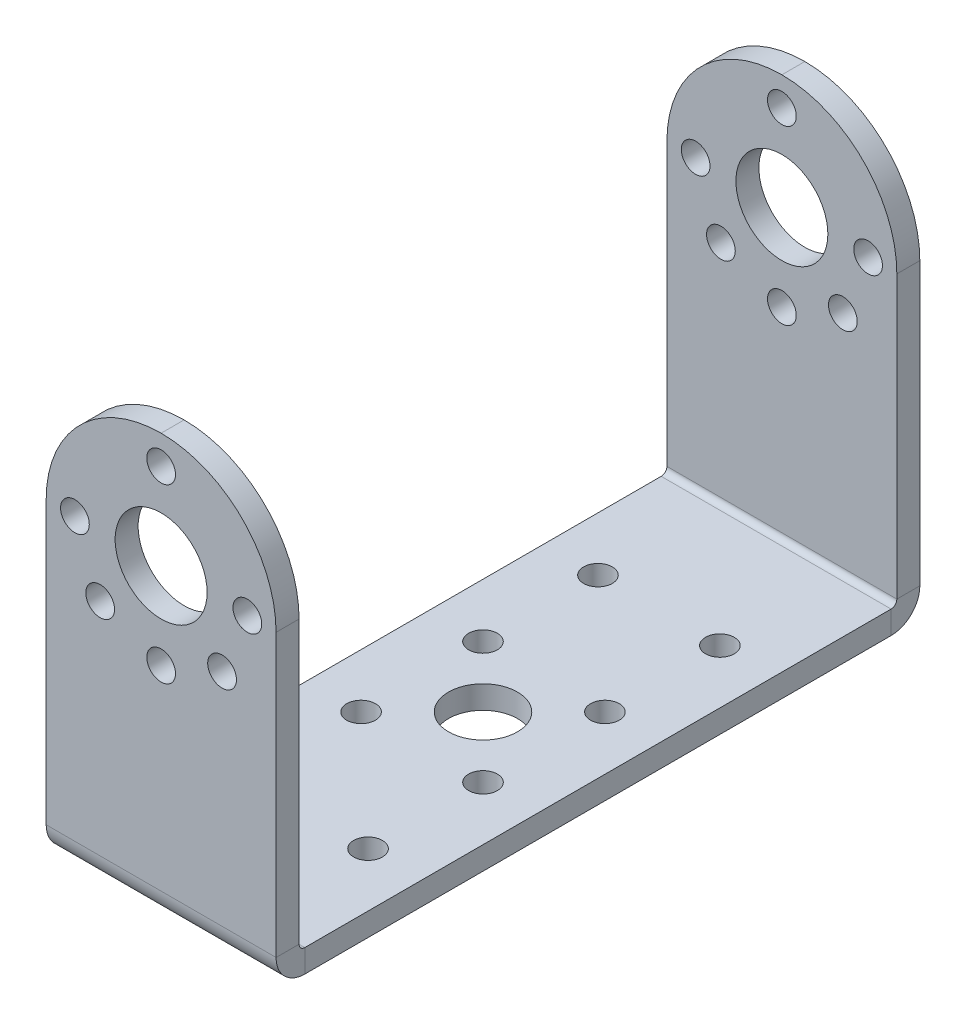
ISO-10303-21;
HEADER;
FILE_DESCRIPTION(('STEP AP214'),'2;1');
FILE_NAME('part.step','',(''),(''),'','','');
FILE_SCHEMA(('AUTOMOTIVE_DESIGN { 1 0 10303 214 1 1 1 1 }'));
ENDSEC;
DATA;
#1=APPLICATION_CONTEXT('core data for automotive mechanical design processes');
#2=APPLICATION_PROTOCOL_DEFINITION('international standard','automotive_design',2000,#1);
#3=PRODUCT_CONTEXT('',#1,'mechanical');
#4=PRODUCT('Part','Part','',(#3));
#5=PRODUCT_RELATED_PRODUCT_CATEGORY('part','',(#4));
#6=PRODUCT_DEFINITION_FORMATION('','',#4);
#7=PRODUCT_DEFINITION_CONTEXT('part definition',#1,'design');
#8=PRODUCT_DEFINITION('design','',#6,#7);
#9=PRODUCT_DEFINITION_SHAPE('','',#8);
#10=(LENGTH_UNIT() NAMED_UNIT(*) SI_UNIT(.MILLI.,.METRE.));
#11=(NAMED_UNIT(*) PLANE_ANGLE_UNIT() SI_UNIT($,.RADIAN.));
#12=(NAMED_UNIT(*) SI_UNIT($,.STERADIAN.) SOLID_ANGLE_UNIT());
#13=UNCERTAINTY_MEASURE_WITH_UNIT(LENGTH_MEASURE(1.E-05),#10,'distance_accuracy_value','');
#14=(GEOMETRIC_REPRESENTATION_CONTEXT(3) GLOBAL_UNCERTAINTY_ASSIGNED_CONTEXT((#13)) GLOBAL_UNIT_ASSIGNED_CONTEXT((#10,
#11,#12)) REPRESENTATION_CONTEXT('',''));
#15=CARTESIAN_POINT('',(0.,0.,0.));
#16=DIRECTION('',(0.,0.,1.));
#17=DIRECTION('',(1.,0.,0.));
#18=AXIS2_PLACEMENT_3D('',#15,#16,#17);
#19=CARTESIAN_POINT('',(10.,0.,25.5));
#20=DIRECTION('',(1.,0.,0.));
#21=DIRECTION('',(0.,0.,-1.));
#22=AXIS2_PLACEMENT_3D('',#19,#20,#21);
#23=PLANE('',#22);
#24=DIRECTION('',(0.,-1.,0.));
#25=VECTOR('',#24,1.);
#26=CARTESIAN_POINT('',(10.,0.,25.5));
#27=LINE('',#26,#25);
#28=CARTESIAN_POINT('',(10.,0.,25.5));
#29=VERTEX_POINT('',#28);
#30=CARTESIAN_POINT('',(10.,-2.00000000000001,25.5));
#31=VERTEX_POINT('',#30);
#32=EDGE_CURVE('E285',#29,#31,#27,.T.);
#33=ORIENTED_EDGE('',*,*,#32,.F.);
#34=CARTESIAN_POINT('',(10.,0.499999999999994,25.5));
#35=DIRECTION('',(-1.,0.,0.));
#36=DIRECTION('',(0.,0.,1.));
#37=AXIS2_PLACEMENT_3D('',#34,#35,#36);
#38=CIRCLE('',#37,0.5);
#39=CARTESIAN_POINT('',(10.,0.499999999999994,26.));
#40=VERTEX_POINT('',#39);
#41=EDGE_CURVE('E199',#40,#29,#38,.F.);
#42=ORIENTED_EDGE('',*,*,#41,.F.);
#43=DIRECTION('',(0.,0.,-1.));
#44=VECTOR('',#43,1.);
#45=CARTESIAN_POINT('',(10.,0.499999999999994,28.));
#46=LINE('',#45,#44);
#47=CARTESIAN_POINT('',(10.,0.499999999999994,28.));
#48=VERTEX_POINT('',#47);
#49=EDGE_CURVE('E282',#48,#40,#46,.T.);
#50=ORIENTED_EDGE('',*,*,#49,.F.);
#51=CARTESIAN_POINT('',(10.,0.499999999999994,25.5));
#52=DIRECTION('',(1.,0.,0.));
#53=DIRECTION('',(0.,0.,-1.));
#54=AXIS2_PLACEMENT_3D('',#51,#52,#53);
#55=CIRCLE('',#54,2.5);
#56=EDGE_CURVE('E209',#48,#31,#55,.T.);
#57=ORIENTED_EDGE('',*,*,#56,.T.);
#58=EDGE_LOOP('',(#33,#42,#50,#57));
#59=FACE_BOUND('',#58,.T.);
#60=ADVANCED_FACE('F42',(#59),#23,.T.);
#61=CARTESIAN_POINT('',(10.,0.499999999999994,28.));
#62=DIRECTION('',(1.,0.,0.));
#63=DIRECTION('',(0.,0.,-1.));
#64=AXIS2_PLACEMENT_3D('',#61,#62,#63);
#65=PLANE('',#64);
#66=DIRECTION('',(0.,0.,-1.));
#67=VECTOR('',#66,1.);
#68=CARTESIAN_POINT('',(10.,0.,-26.));
#69=LINE('',#68,#67);
#70=CARTESIAN_POINT('',(10.,0.,-25.5));
#71=VERTEX_POINT('',#70);
#72=EDGE_CURVE('E195',#29,#71,#69,.T.);
#73=ORIENTED_EDGE('',*,*,#72,.F.);
#74=ORIENTED_EDGE('',*,*,#32,.T.);
#75=DIRECTION('',(0.,0.,-1.));
#76=VECTOR('',#75,1.);
#77=CARTESIAN_POINT('',(10.,-2.00000000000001,-26.));
#78=LINE('',#77,#76);
#79=CARTESIAN_POINT('',(10.,-2.00000000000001,-25.5));
#80=VERTEX_POINT('',#79);
#81=EDGE_CURVE('E212',#31,#80,#78,.T.);
#82=ORIENTED_EDGE('',*,*,#81,.T.);
#83=DIRECTION('',(0.,1.,0.));
#84=VECTOR('',#83,1.);
#85=CARTESIAN_POINT('',(10.,-2.00000000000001,-25.5));
#86=LINE('',#85,#84);
#87=EDGE_CURVE('E166',#80,#71,#86,.T.);
#88=ORIENTED_EDGE('',*,*,#87,.T.);
#89=EDGE_LOOP('',(#73,#74,#82,#88));
#90=FACE_BOUND('',#89,.T.);
#91=ADVANCED_FACE('F365',(#90),#65,.T.);
#92=CARTESIAN_POINT('',(-10.,0.499999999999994,26.));
#93=DIRECTION('',(-1.,0.,0.));
#94=DIRECTION('',(0.,0.,1.));
#95=AXIS2_PLACEMENT_3D('',#92,#93,#94);
#96=PLANE('',#95);
#97=DIRECTION('',(0.,0.,1.));
#98=VECTOR('',#97,1.);
#99=CARTESIAN_POINT('',(-10.,0.499999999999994,26.));
#100=LINE('',#99,#98);
#101=CARTESIAN_POINT('',(-10.,0.499999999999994,26.));
#102=VERTEX_POINT('',#101);
#103=CARTESIAN_POINT('',(-10.,0.499999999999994,28.));
#104=VERTEX_POINT('',#103);
#105=EDGE_CURVE('E279',#102,#104,#100,.T.);
#106=ORIENTED_EDGE('',*,*,#105,.F.);
#107=CARTESIAN_POINT('',(-10.,0.499999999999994,25.5));
#108=DIRECTION('',(-1.,0.,0.));
#109=DIRECTION('',(0.,0.,1.));
#110=AXIS2_PLACEMENT_3D('',#107,#108,#109);
#111=CIRCLE('',#110,0.5);
#112=CARTESIAN_POINT('',(-10.,0.,25.5));
#113=VERTEX_POINT('',#112);
#114=EDGE_CURVE('E232',#102,#113,#111,.F.);
#115=ORIENTED_EDGE('',*,*,#114,.T.);
#116=DIRECTION('',(0.,1.,0.));
#117=VECTOR('',#116,1.);
#118=CARTESIAN_POINT('',(-10.,-2.00000000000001,25.5));
#119=LINE('',#118,#117);
#120=CARTESIAN_POINT('',(-10.,-2.00000000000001,25.5));
#121=VERTEX_POINT('',#120);
#122=EDGE_CURVE('E165',#121,#113,#119,.T.);
#123=ORIENTED_EDGE('',*,*,#122,.F.);
#124=CARTESIAN_POINT('',(-10.,0.499999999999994,25.5));
#125=DIRECTION('',(1.,0.,0.));
#126=DIRECTION('',(0.,0.,-1.));
#127=AXIS2_PLACEMENT_3D('',#124,#125,#126);
#128=CIRCLE('',#127,2.5);
#129=EDGE_CURVE('E239',#104,#121,#128,.T.);
#130=ORIENTED_EDGE('',*,*,#129,.F.);
#131=EDGE_LOOP('',(#106,#115,#123,#130));
#132=FACE_BOUND('',#131,.T.);
#133=ADVANCED_FACE('F353',(#132),#96,.T.);
#134=CARTESIAN_POINT('',(-10.,-2.00000000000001,25.5));
#135=DIRECTION('',(-1.,0.,0.));
#136=DIRECTION('',(0.,0.,1.));
#137=AXIS2_PLACEMENT_3D('',#134,#135,#136);
#138=PLANE('',#137);
#139=DIRECTION('',(0.,1.,0.));
#140=VECTOR('',#139,1.);
#141=CARTESIAN_POINT('',(-10.,0.,28.));
#142=LINE('',#141,#140);
#143=CARTESIAN_POINT('',(-10.,25.,28.));
#144=VERTEX_POINT('',#143);
#145=EDGE_CURVE('E237',#144,#104,#142,.F.);
#146=ORIENTED_EDGE('',*,*,#145,.F.);
#147=DIRECTION('',(0.,0.,-1.));
#148=VECTOR('',#147,1.);
#149=CARTESIAN_POINT('',(-10.,25.,25.5));
#150=LINE('',#149,#148);
#151=CARTESIAN_POINT('',(-10.,25.,26.));
#152=VERTEX_POINT('',#151);
#153=EDGE_CURVE('E299',#144,#152,#150,.T.);
#154=ORIENTED_EDGE('',*,*,#153,.T.);
#155=DIRECTION('',(0.,-1.,0.));
#156=VECTOR('',#155,1.);
#157=CARTESIAN_POINT('',(-10.,0.,26.));
#158=LINE('',#157,#156);
#159=EDGE_CURVE('E235',#152,#102,#158,.T.);
#160=ORIENTED_EDGE('',*,*,#159,.T.);
#161=ORIENTED_EDGE('',*,*,#105,.T.);
#162=EDGE_LOOP('',(#146,#154,#160,#161));
#163=FACE_BOUND('',#162,.T.);
#164=ADVANCED_FACE('F375',(#163),#138,.T.);
#165=CARTESIAN_POINT('',(10.,0.499999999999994,-26.));
#166=DIRECTION('',(1.,0.,0.));
#167=DIRECTION('',(0.,0.,-1.));
#168=AXIS2_PLACEMENT_3D('',#165,#166,#167);
#169=PLANE('',#168);
#170=DIRECTION('',(0.,0.,-1.));
#171=VECTOR('',#170,1.);
#172=CARTESIAN_POINT('',(10.,0.499999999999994,-26.));
#173=LINE('',#172,#171);
#174=CARTESIAN_POINT('',(10.,0.499999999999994,-26.));
#175=VERTEX_POINT('',#174);
#176=CARTESIAN_POINT('',(10.,0.499999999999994,-28.));
#177=VERTEX_POINT('',#176);
#178=EDGE_CURVE('E152',#175,#177,#173,.T.);
#179=ORIENTED_EDGE('',*,*,#178,.F.);
#180=CARTESIAN_POINT('',(10.,0.499999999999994,-25.5));
#181=DIRECTION('',(-1.,0.,0.));
#182=DIRECTION('',(0.,0.,1.));
#183=AXIS2_PLACEMENT_3D('',#180,#181,#182);
#184=CIRCLE('',#183,0.5);
#185=EDGE_CURVE('E156',#71,#175,#184,.F.);
#186=ORIENTED_EDGE('',*,*,#185,.F.);
#187=ORIENTED_EDGE('',*,*,#87,.F.);
#188=CARTESIAN_POINT('',(10.,0.499999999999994,-25.5));
#189=DIRECTION('',(1.,0.,0.));
#190=DIRECTION('',(0.,0.,-1.));
#191=AXIS2_PLACEMENT_3D('',#188,#189,#190);
#192=CIRCLE('',#191,2.5);
#193=EDGE_CURVE('E159',#80,#177,#192,.T.);
#194=ORIENTED_EDGE('',*,*,#193,.T.);
#195=EDGE_LOOP('',(#179,#186,#187,#194));
#196=FACE_BOUND('',#195,.T.);
#197=ADVANCED_FACE('F154',(#196),#169,.T.);
#198=CARTESIAN_POINT('',(10.,-2.00000000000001,-25.5));
#199=DIRECTION('',(1.,0.,0.));
#200=DIRECTION('',(0.,0.,-1.));
#201=AXIS2_PLACEMENT_3D('',#198,#199,#200);
#202=PLANE('',#201);
#203=DIRECTION('',(0.,1.,0.));
#204=VECTOR('',#203,1.);
#205=CARTESIAN_POINT('',(10.,0.,-28.));
#206=LINE('',#205,#204);
#207=CARTESIAN_POINT('',(10.,25.,-28.));
#208=VERTEX_POINT('',#207);
#209=EDGE_CURVE('E189',#177,#208,#206,.T.);
#210=ORIENTED_EDGE('',*,*,#209,.T.);
#211=DIRECTION('',(0.,0.,-1.));
#212=VECTOR('',#211,1.);
#213=CARTESIAN_POINT('',(10.,25.,-25.5));
#214=LINE('',#213,#212);
#215=CARTESIAN_POINT('',(10.,25.,-26.));
#216=VERTEX_POINT('',#215);
#217=EDGE_CURVE('E187',#208,#216,#214,.F.);
#218=ORIENTED_EDGE('',*,*,#217,.T.);
#219=DIRECTION('',(0.,1.,0.));
#220=VECTOR('',#219,1.);
#221=CARTESIAN_POINT('',(10.,0.,-26.));
#222=LINE('',#221,#220);
#223=EDGE_CURVE('E174',#175,#216,#222,.T.);
#224=ORIENTED_EDGE('',*,*,#223,.F.);
#225=ORIENTED_EDGE('',*,*,#178,.T.);
#226=EDGE_LOOP('',(#210,#218,#224,#225));
#227=FACE_BOUND('',#226,.T.);
#228=ADVANCED_FACE('F185',(#227),#202,.T.);
#229=CARTESIAN_POINT('',(-10.,0.,-25.5));
#230=DIRECTION('',(-1.,0.,0.));
#231=DIRECTION('',(0.,0.,1.));
#232=AXIS2_PLACEMENT_3D('',#229,#230,#231);
#233=PLANE('',#232);
#234=DIRECTION('',(0.,-1.,0.));
#235=VECTOR('',#234,1.);
#236=CARTESIAN_POINT('',(-10.,0.,-25.5));
#237=LINE('',#236,#235);
#238=CARTESIAN_POINT('',(-10.,0.,-25.5));
#239=VERTEX_POINT('',#238);
#240=CARTESIAN_POINT('',(-10.,-2.00000000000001,-25.5));
#241=VERTEX_POINT('',#240);
#242=EDGE_CURVE('E273',#239,#241,#237,.T.);
#243=ORIENTED_EDGE('',*,*,#242,.F.);
#244=CARTESIAN_POINT('',(-10.,0.499999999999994,-25.5));
#245=DIRECTION('',(-1.,0.,0.));
#246=DIRECTION('',(0.,0.,1.));
#247=AXIS2_PLACEMENT_3D('',#244,#245,#246);
#248=CIRCLE('',#247,0.5);
#249=CARTESIAN_POINT('',(-10.,0.499999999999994,-26.));
#250=VERTEX_POINT('',#249);
#251=EDGE_CURVE('E225',#239,#250,#248,.F.);
#252=ORIENTED_EDGE('',*,*,#251,.T.);
#253=DIRECTION('',(0.,0.,1.));
#254=VECTOR('',#253,1.);
#255=CARTESIAN_POINT('',(-10.,0.499999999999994,-28.));
#256=LINE('',#255,#254);
#257=CARTESIAN_POINT('',(-10.,0.499999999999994,-28.));
#258=VERTEX_POINT('',#257);
#259=EDGE_CURVE('E182',#258,#250,#256,.T.);
#260=ORIENTED_EDGE('',*,*,#259,.F.);
#261=CARTESIAN_POINT('',(-10.,0.499999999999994,-25.5));
#262=DIRECTION('',(1.,0.,0.));
#263=DIRECTION('',(0.,0.,-1.));
#264=AXIS2_PLACEMENT_3D('',#261,#262,#263);
#265=CIRCLE('',#264,2.5);
#266=EDGE_CURVE('E246',#241,#258,#265,.T.);
#267=ORIENTED_EDGE('',*,*,#266,.F.);
#268=EDGE_LOOP('',(#243,#252,#260,#267));
#269=FACE_BOUND('',#268,.T.);
#270=ADVANCED_FACE('F341',(#269),#233,.T.);
#271=CARTESIAN_POINT('',(-10.,0.499999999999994,-28.));
#272=DIRECTION('',(-1.,0.,0.));
#273=DIRECTION('',(0.,0.,1.));
#274=AXIS2_PLACEMENT_3D('',#271,#272,#273);
#275=PLANE('',#274);
#276=DIRECTION('',(0.,0.,-1.));
#277=VECTOR('',#276,1.);
#278=CARTESIAN_POINT('',(-10.,0.,-26.));
#279=LINE('',#278,#277);
#280=EDGE_CURVE('E228',#113,#239,#279,.T.);
#281=ORIENTED_EDGE('',*,*,#280,.T.);
#282=ORIENTED_EDGE('',*,*,#242,.T.);
#283=DIRECTION('',(0.,0.,-1.));
#284=VECTOR('',#283,1.);
#285=CARTESIAN_POINT('',(-10.,-2.00000000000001,-26.));
#286=LINE('',#285,#284);
#287=EDGE_CURVE('E242',#121,#241,#286,.T.);
#288=ORIENTED_EDGE('',*,*,#287,.F.);
#289=ORIENTED_EDGE('',*,*,#122,.T.);
#290=EDGE_LOOP('',(#281,#282,#288,#289));
#291=FACE_BOUND('',#290,.T.);
#292=ADVANCED_FACE('F344',(#291),#275,.T.);
#293=CARTESIAN_POINT('',(10.,0.,-28.));
#294=DIRECTION('',(0.,0.,1.));
#295=DIRECTION('',(1.,0.,0.));
#296=AXIS2_PLACEMENT_3D('',#293,#294,#295);
#297=PLANE('',#296);
#298=CARTESIAN_POINT('',(-7.5,25.,-28.));
#299=DIRECTION('',(0.,0.,1.));
#300=DIRECTION('',(1.,0.,0.));
#301=AXIS2_PLACEMENT_3D('',#298,#299,#300);
#302=CIRCLE('',#301,1.25);
#303=CARTESIAN_POINT('',(-6.25,25.,-28.));
#304=VERTEX_POINT('',#303);
#305=EDGE_CURVE('E890',#304,#304,#302,.T.);
#306=ORIENTED_EDGE('',*,*,#305,.T.);
#307=EDGE_LOOP('',(#306));
#308=FACE_BOUND('',#307,.T.);
#309=CARTESIAN_POINT('',(-5.30330085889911,19.6966991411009,-28.));
#310=DIRECTION('',(0.,0.,1.));
#311=DIRECTION('',(1.,0.,0.));
#312=AXIS2_PLACEMENT_3D('',#309,#310,#311);
#313=CIRCLE('',#312,1.25);
#314=CARTESIAN_POINT('',(-4.05330085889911,19.6966991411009,-28.));
#315=VERTEX_POINT('',#314);
#316=EDGE_CURVE('E894',#315,#315,#313,.T.);
#317=ORIENTED_EDGE('',*,*,#316,.T.);
#318=EDGE_LOOP('',(#317));
#319=FACE_BOUND('',#318,.T.);
#320=CARTESIAN_POINT('',(0.,17.5,-28.));
#321=DIRECTION('',(0.,0.,1.));
#322=DIRECTION('',(1.,0.,0.));
#323=AXIS2_PLACEMENT_3D('',#320,#321,#322);
#324=CIRCLE('',#323,1.25);
#325=CARTESIAN_POINT('',(1.25,17.5,-28.));
#326=VERTEX_POINT('',#325);
#327=EDGE_CURVE('E898',#326,#326,#324,.T.);
#328=ORIENTED_EDGE('',*,*,#327,.T.);
#329=EDGE_LOOP('',(#328));
#330=FACE_BOUND('',#329,.T.);
#331=CARTESIAN_POINT('',(5.30330085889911,19.6966991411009,-28.));
#332=DIRECTION('',(0.,0.,1.));
#333=DIRECTION('',(1.,0.,0.));
#334=AXIS2_PLACEMENT_3D('',#331,#332,#333);
#335=CIRCLE('',#334,1.25);
#336=CARTESIAN_POINT('',(6.55330085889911,19.6966991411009,-28.));
#337=VERTEX_POINT('',#336);
#338=EDGE_CURVE('E902',#337,#337,#335,.T.);
#339=ORIENTED_EDGE('',*,*,#338,.T.);
#340=EDGE_LOOP('',(#339));
#341=FACE_BOUND('',#340,.T.);
#342=CARTESIAN_POINT('',(7.5,25.,-28.));
#343=DIRECTION('',(0.,0.,1.));
#344=DIRECTION('',(1.,0.,0.));
#345=AXIS2_PLACEMENT_3D('',#342,#343,#344);
#346=CIRCLE('',#345,1.25);
#347=CARTESIAN_POINT('',(8.75,25.,-28.));
#348=VERTEX_POINT('',#347);
#349=EDGE_CURVE('E906',#348,#348,#346,.T.);
#350=ORIENTED_EDGE('',*,*,#349,.T.);
#351=EDGE_LOOP('',(#350));
#352=FACE_BOUND('',#351,.T.);
#353=CARTESIAN_POINT('',(0.,32.5,-28.));
#354=DIRECTION('',(0.,0.,1.));
#355=DIRECTION('',(1.,0.,0.));
#356=AXIS2_PLACEMENT_3D('',#353,#354,#355);
#357=CIRCLE('',#356,1.25);
#358=CARTESIAN_POINT('',(1.25,32.5,-28.));
#359=VERTEX_POINT('',#358);
#360=EDGE_CURVE('E910',#359,#359,#357,.T.);
#361=ORIENTED_EDGE('',*,*,#360,.T.);
#362=EDGE_LOOP('',(#361));
#363=FACE_BOUND('',#362,.T.);
#364=CARTESIAN_POINT('',(0.,25.,-28.));
#365=DIRECTION('',(0.,0.,1.));
#366=DIRECTION('',(1.,0.,0.));
#367=AXIS2_PLACEMENT_3D('',#364,#365,#366);
#368=CIRCLE('',#367,4.);
#369=CARTESIAN_POINT('',(4.,25.,-28.));
#370=VERTEX_POINT('',#369);
#371=EDGE_CURVE('E321',#370,#370,#368,.T.);
#372=ORIENTED_EDGE('',*,*,#371,.T.);
#373=EDGE_LOOP('',(#372));
#374=FACE_BOUND('',#373,.T.);
#375=DIRECTION('',(0.,1.,0.));
#376=VECTOR('',#375,1.);
#377=CARTESIAN_POINT('',(-10.,0.,-28.));
#378=LINE('',#377,#376);
#379=CARTESIAN_POINT('',(-10.,25.,-28.));
#380=VERTEX_POINT('',#379);
#381=EDGE_CURVE('E218',#258,#380,#378,.T.);
#382=ORIENTED_EDGE('',*,*,#381,.T.);
#383=CARTESIAN_POINT('',(0.,25.,-28.));
#384=DIRECTION('',(0.,0.,1.));
#385=DIRECTION('',(1.,0.,0.));
#386=AXIS2_PLACEMENT_3D('',#383,#384,#385);
#387=CIRCLE('',#386,10.);
#388=CARTESIAN_POINT('',(0.,35.,-28.));
#389=VERTEX_POINT('',#388);
#390=EDGE_CURVE('E292',#380,#389,#387,.F.);
#391=ORIENTED_EDGE('',*,*,#390,.T.);
#392=CARTESIAN_POINT('',(0.,25.,-28.));
#393=DIRECTION('',(0.,0.,1.));
#394=DIRECTION('',(1.,0.,0.));
#395=AXIS2_PLACEMENT_3D('',#392,#393,#394);
#396=CIRCLE('',#395,10.);
#397=EDGE_CURVE('E290',#389,#208,#396,.F.);
#398=ORIENTED_EDGE('',*,*,#397,.T.);
#399=ORIENTED_EDGE('',*,*,#209,.F.);
#400=DIRECTION('',(-1.,0.,0.));
#401=VECTOR('',#400,1.);
#402=CARTESIAN_POINT('',(10.,0.499999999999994,-28.));
#403=LINE('',#402,#401);
#404=EDGE_CURVE('E217',#177,#258,#403,.T.);
#405=ORIENTED_EDGE('',*,*,#404,.T.);
#406=EDGE_LOOP('',(#382,#391,#398,#399,#405));
#407=FACE_BOUND('',#406,.T.);
#408=ADVANCED_FACE('F335',(#308,#319,#330,#341,#352,#363,#374,#407),#297,.F.);
#409=CARTESIAN_POINT('',(10.,0.,-26.));
#410=DIRECTION('',(0.,0.,1.));
#411=DIRECTION('',(1.,0.,0.));
#412=AXIS2_PLACEMENT_3D('',#409,#410,#411);
#413=PLANE('',#412);
#414=CARTESIAN_POINT('',(-7.5,25.,-26.));
#415=DIRECTION('',(0.,0.,1.));
#416=DIRECTION('',(1.,0.,0.));
#417=AXIS2_PLACEMENT_3D('',#414,#415,#416);
#418=CIRCLE('',#417,1.25);
#419=CARTESIAN_POINT('',(-6.25,25.,-26.));
#420=VERTEX_POINT('',#419);
#421=EDGE_CURVE('E917',#420,#420,#418,.T.);
#422=ORIENTED_EDGE('',*,*,#421,.F.);
#423=EDGE_LOOP('',(#422));
#424=FACE_BOUND('',#423,.T.);
#425=CARTESIAN_POINT('',(-5.30330085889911,19.6966991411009,-26.));
#426=DIRECTION('',(0.,0.,1.));
#427=DIRECTION('',(1.,0.,0.));
#428=AXIS2_PLACEMENT_3D('',#425,#426,#427);
#429=CIRCLE('',#428,1.25);
#430=CARTESIAN_POINT('',(-4.05330085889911,19.6966991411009,-26.));
#431=VERTEX_POINT('',#430);
#432=EDGE_CURVE('E924',#431,#431,#429,.T.);
#433=ORIENTED_EDGE('',*,*,#432,.F.);
#434=EDGE_LOOP('',(#433));
#435=FACE_BOUND('',#434,.T.);
#436=CARTESIAN_POINT('',(0.,17.5,-26.));
#437=DIRECTION('',(0.,0.,1.));
#438=DIRECTION('',(1.,0.,0.));
#439=AXIS2_PLACEMENT_3D('',#436,#437,#438);
#440=CIRCLE('',#439,1.25);
#441=CARTESIAN_POINT('',(1.25,17.5,-26.));
#442=VERTEX_POINT('',#441);
#443=EDGE_CURVE('E931',#442,#442,#440,.T.);
#444=ORIENTED_EDGE('',*,*,#443,.F.);
#445=EDGE_LOOP('',(#444));
#446=FACE_BOUND('',#445,.T.);
#447=CARTESIAN_POINT('',(5.30330085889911,19.6966991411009,-26.));
#448=DIRECTION('',(0.,0.,1.));
#449=DIRECTION('',(1.,0.,0.));
#450=AXIS2_PLACEMENT_3D('',#447,#448,#449);
#451=CIRCLE('',#450,1.25);
#452=CARTESIAN_POINT('',(6.55330085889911,19.6966991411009,-26.));
#453=VERTEX_POINT('',#452);
#454=EDGE_CURVE('E938',#453,#453,#451,.T.);
#455=ORIENTED_EDGE('',*,*,#454,.F.);
#456=EDGE_LOOP('',(#455));
#457=FACE_BOUND('',#456,.T.);
#458=CARTESIAN_POINT('',(7.5,25.,-26.));
#459=DIRECTION('',(0.,0.,1.));
#460=DIRECTION('',(1.,0.,0.));
#461=AXIS2_PLACEMENT_3D('',#458,#459,#460);
#462=CIRCLE('',#461,1.25);
#463=CARTESIAN_POINT('',(8.75,25.,-26.));
#464=VERTEX_POINT('',#463);
#465=EDGE_CURVE('E945',#464,#464,#462,.T.);
#466=ORIENTED_EDGE('',*,*,#465,.F.);
#467=EDGE_LOOP('',(#466));
#468=FACE_BOUND('',#467,.T.);
#469=CARTESIAN_POINT('',(0.,32.5,-26.));
#470=DIRECTION('',(0.,0.,1.));
#471=DIRECTION('',(1.,0.,0.));
#472=AXIS2_PLACEMENT_3D('',#469,#470,#471);
#473=CIRCLE('',#472,1.25);
#474=CARTESIAN_POINT('',(1.25,32.5,-26.));
#475=VERTEX_POINT('',#474);
#476=EDGE_CURVE('E951',#475,#475,#473,.T.);
#477=ORIENTED_EDGE('',*,*,#476,.F.);
#478=EDGE_LOOP('',(#477));
#479=FACE_BOUND('',#478,.T.);
#480=CARTESIAN_POINT('',(0.,25.,-26.));
#481=DIRECTION('',(0.,0.,1.));
#482=DIRECTION('',(1.,0.,0.));
#483=AXIS2_PLACEMENT_3D('',#480,#481,#482);
#484=CIRCLE('',#483,4.);
#485=CARTESIAN_POINT('',(4.,25.,-26.));
#486=VERTEX_POINT('',#485);
#487=EDGE_CURVE('E312',#486,#486,#484,.T.);
#488=ORIENTED_EDGE('',*,*,#487,.F.);
#489=EDGE_LOOP('',(#488));
#490=FACE_BOUND('',#489,.T.);
#491=CARTESIAN_POINT('',(0.,25.,-26.));
#492=DIRECTION('',(0.,0.,1.));
#493=DIRECTION('',(1.,0.,0.));
#494=AXIS2_PLACEMENT_3D('',#491,#492,#493);
#495=CIRCLE('',#494,10.);
#496=CARTESIAN_POINT('',(0.,35.,-26.));
#497=VERTEX_POINT('',#496);
#498=EDGE_CURVE('E294',#216,#497,#495,.T.);
#499=ORIENTED_EDGE('',*,*,#498,.T.);
#500=CARTESIAN_POINT('',(0.,25.,-26.));
#501=DIRECTION('',(0.,0.,1.));
#502=DIRECTION('',(1.,0.,0.));
#503=AXIS2_PLACEMENT_3D('',#500,#501,#502);
#504=CIRCLE('',#503,10.);
#505=CARTESIAN_POINT('',(-10.,25.,-26.));
#506=VERTEX_POINT('',#505);
#507=EDGE_CURVE('E296',#497,#506,#504,.T.);
#508=ORIENTED_EDGE('',*,*,#507,.T.);
#509=DIRECTION('',(0.,1.,0.));
#510=VECTOR('',#509,1.);
#511=CARTESIAN_POINT('',(-10.,0.,-26.));
#512=LINE('',#511,#510);
#513=EDGE_CURVE('E177',#250,#506,#512,.T.);
#514=ORIENTED_EDGE('',*,*,#513,.F.);
#515=DIRECTION('',(-1.,0.,0.));
#516=VECTOR('',#515,1.);
#517=CARTESIAN_POINT('',(10.,0.499999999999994,-26.));
#518=LINE('',#517,#516);
#519=EDGE_CURVE('E172',#175,#250,#518,.T.);
#520=ORIENTED_EDGE('',*,*,#519,.F.);
#521=ORIENTED_EDGE('',*,*,#223,.T.);
#522=EDGE_LOOP('',(#499,#508,#514,#520,#521));
#523=FACE_BOUND('',#522,.T.);
#524=ADVANCED_FACE('F173',(#424,#435,#446,#457,#468,#479,#490,#523),#413,.T.);
#525=CARTESIAN_POINT('',(10.,0.499999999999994,-25.5));
#526=DIRECTION('',(-1.,0.,0.));
#527=DIRECTION('',(0.,0.,1.));
#528=AXIS2_PLACEMENT_3D('',#525,#526,#527);
#529=CYLINDRICAL_SURFACE('',#528,0.5);
#530=ORIENTED_EDGE('',*,*,#251,.F.);
#531=DIRECTION('',(-1.,0.,0.));
#532=VECTOR('',#531,1.);
#533=CARTESIAN_POINT('',(10.,0.,-25.5));
#534=LINE('',#533,#532);
#535=EDGE_CURVE('E183',#71,#239,#534,.T.);
#536=ORIENTED_EDGE('',*,*,#535,.F.);
#537=ORIENTED_EDGE('',*,*,#185,.T.);
#538=ORIENTED_EDGE('',*,*,#519,.T.);
#539=EDGE_LOOP('',(#530,#536,#537,#538));
#540=FACE_BOUND('',#539,.T.);
#541=ADVANCED_FACE('F192',(#540),#529,.F.);
#542=CARTESIAN_POINT('',(10.,0.,-26.));
#543=DIRECTION('',(0.,1.,0.));
#544=DIRECTION('',(0.,0.,1.));
#545=AXIS2_PLACEMENT_3D('',#542,#543,#544);
#546=PLANE('',#545);
#547=CARTESIAN_POINT('',(-5.30330085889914,0.,15.3033008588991));
#548=DIRECTION('',(0.,1.,0.));
#549=DIRECTION('',(0.,0.,-1.));
#550=AXIS2_PLACEMENT_3D('',#547,#548,#549);
#551=CIRCLE('',#550,1.25);
#552=CARTESIAN_POINT('',(-5.30330085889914,0.,14.0533008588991));
#553=VERTEX_POINT('',#552);
#554=EDGE_CURVE('E1022',#553,#553,#551,.T.);
#555=ORIENTED_EDGE('',*,*,#554,.F.);
#556=EDGE_LOOP('',(#555));
#557=FACE_BOUND('',#556,.T.);
#558=CARTESIAN_POINT('',(5.30330085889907,0.,15.3033008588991));
#559=DIRECTION('',(0.,1.,0.));
#560=DIRECTION('',(0.,0.,-1.));
#561=AXIS2_PLACEMENT_3D('',#558,#559,#560);
#562=CIRCLE('',#561,1.25);
#563=CARTESIAN_POINT('',(5.30330085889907,0.,14.0533008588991));
#564=VERTEX_POINT('',#563);
#565=EDGE_CURVE('E1028',#564,#564,#562,.T.);
#566=ORIENTED_EDGE('',*,*,#565,.F.);
#567=EDGE_LOOP('',(#566));
#568=FACE_BOUND('',#567,.T.);
#569=CARTESIAN_POINT('',(-5.30330085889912,0.,-5.30330085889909));
#570=DIRECTION('',(0.,1.,0.));
#571=DIRECTION('',(0.,0.,1.));
#572=AXIS2_PLACEMENT_3D('',#569,#570,#571);
#573=CIRCLE('',#572,1.25);
#574=CARTESIAN_POINT('',(-5.30330085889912,0.,-4.05330085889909));
#575=VERTEX_POINT('',#574);
#576=EDGE_CURVE('E1034',#575,#575,#573,.T.);
#577=ORIENTED_EDGE('',*,*,#576,.F.);
#578=EDGE_LOOP('',(#577));
#579=FACE_BOUND('',#578,.T.);
#580=CARTESIAN_POINT('',(-5.30330085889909,0.,5.30330085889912));
#581=DIRECTION('',(0.,1.,0.));
#582=DIRECTION('',(0.,0.,1.));
#583=AXIS2_PLACEMENT_3D('',#580,#581,#582);
#584=CIRCLE('',#583,1.25);
#585=CARTESIAN_POINT('',(-5.30330085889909,0.,6.55330085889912));
#586=VERTEX_POINT('',#585);
#587=EDGE_CURVE('E1042',#586,#586,#584,.T.);
#588=ORIENTED_EDGE('',*,*,#587,.F.);
#589=EDGE_LOOP('',(#588));
#590=FACE_BOUND('',#589,.T.);
#591=CARTESIAN_POINT('',(5.3033008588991,0.,-5.30330085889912));
#592=DIRECTION('',(0.,1.,0.));
#593=DIRECTION('',(0.,0.,1.));
#594=AXIS2_PLACEMENT_3D('',#591,#592,#593);
#595=CIRCLE('',#594,1.25);
#596=CARTESIAN_POINT('',(5.3033008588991,0.,-4.05330085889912));
#597=VERTEX_POINT('',#596);
#598=EDGE_CURVE('E1001',#597,#597,#595,.T.);
#599=ORIENTED_EDGE('',*,*,#598,.F.);
#600=EDGE_LOOP('',(#599));
#601=FACE_BOUND('',#600,.T.);
#602=CARTESIAN_POINT('',(-5.30330085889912,0.,-15.3033008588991));
#603=DIRECTION('',(0.,1.,0.));
#604=DIRECTION('',(0.,0.,1.));
#605=AXIS2_PLACEMENT_3D('',#602,#603,#604);
#606=CIRCLE('',#605,1.25);
#607=CARTESIAN_POINT('',(-5.30330085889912,0.,-14.0533008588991));
#608=VERTEX_POINT('',#607);
#609=EDGE_CURVE('E992',#608,#608,#606,.T.);
#610=ORIENTED_EDGE('',*,*,#609,.F.);
#611=EDGE_LOOP('',(#610));
#612=FACE_BOUND('',#611,.T.);
#613=CARTESIAN_POINT('',(5.3033008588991,0.,-15.3033008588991));
#614=DIRECTION('',(0.,1.,0.));
#615=DIRECTION('',(0.,0.,1.));
#616=AXIS2_PLACEMENT_3D('',#613,#614,#615);
#617=CIRCLE('',#616,1.25);
#618=CARTESIAN_POINT('',(5.3033008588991,0.,-14.0533008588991));
#619=VERTEX_POINT('',#618);
#620=EDGE_CURVE('E1015',#619,#619,#617,.T.);
#621=ORIENTED_EDGE('',*,*,#620,.F.);
#622=EDGE_LOOP('',(#621));
#623=FACE_BOUND('',#622,.T.);
#624=CARTESIAN_POINT('',(5.30330085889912,0.,5.30330085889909));
#625=DIRECTION('',(0.,1.,0.));
#626=DIRECTION('',(0.,0.,1.));
#627=AXIS2_PLACEMENT_3D('',#624,#625,#626);
#628=CIRCLE('',#627,1.25);
#629=CARTESIAN_POINT('',(5.30330085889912,0.,6.5533008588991));
#630=VERTEX_POINT('',#629);
#631=EDGE_CURVE('E1008',#630,#630,#628,.T.);
#632=ORIENTED_EDGE('',*,*,#631,.F.);
#633=EDGE_LOOP('',(#632));
#634=FACE_BOUND('',#633,.T.);
#635=CARTESIAN_POINT('',(0.,0.,0.));
#636=DIRECTION('',(0.,1.,0.));
#637=DIRECTION('',(0.,0.,1.));
#638=AXIS2_PLACEMENT_3D('',#635,#636,#637);
#639=CIRCLE('',#638,3.);
#640=CARTESIAN_POINT('',(0.,0.,3.));
#641=VERTEX_POINT('',#640);
#642=EDGE_CURVE('E984',#641,#641,#639,.T.);
#643=ORIENTED_EDGE('',*,*,#642,.F.);
#644=EDGE_LOOP('',(#643));
#645=FACE_BOUND('',#644,.T.);
#646=ORIENTED_EDGE('',*,*,#280,.F.);
#647=DIRECTION('',(-1.,0.,0.));
#648=VECTOR('',#647,1.);
#649=CARTESIAN_POINT('',(10.,0.,25.5));
#650=LINE('',#649,#648);
#651=EDGE_CURVE('E266',#29,#113,#650,.T.);
#652=ORIENTED_EDGE('',*,*,#651,.F.);
#653=ORIENTED_EDGE('',*,*,#72,.T.);
#654=ORIENTED_EDGE('',*,*,#535,.T.);
#655=EDGE_LOOP('',(#646,#652,#653,#654));
#656=FACE_BOUND('',#655,.T.);
#657=ADVANCED_FACE('F348',(#557,#568,#579,#590,#601,#612,#623,#634,#645,#656),#546,.T.);
#658=CARTESIAN_POINT('',(10.,0.499999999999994,25.5));
#659=DIRECTION('',(-1.,0.,0.));
#660=DIRECTION('',(0.,0.,1.));
#661=AXIS2_PLACEMENT_3D('',#658,#659,#660);
#662=CYLINDRICAL_SURFACE('',#661,0.5);
#663=ORIENTED_EDGE('',*,*,#114,.F.);
#664=DIRECTION('',(-1.,0.,0.));
#665=VECTOR('',#664,1.);
#666=CARTESIAN_POINT('',(10.,0.499999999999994,26.));
#667=LINE('',#666,#665);
#668=EDGE_CURVE('E263',#40,#102,#667,.T.);
#669=ORIENTED_EDGE('',*,*,#668,.F.);
#670=ORIENTED_EDGE('',*,*,#41,.T.);
#671=ORIENTED_EDGE('',*,*,#651,.T.);
#672=EDGE_LOOP('',(#663,#669,#670,#671));
#673=FACE_BOUND('',#672,.T.);
#674=ADVANCED_FACE('F357',(#673),#662,.F.);
#675=CARTESIAN_POINT('',(10.,0.,26.));
#676=DIRECTION('',(0.,0.,-1.));
#677=DIRECTION('',(-1.,0.,0.));
#678=AXIS2_PLACEMENT_3D('',#675,#676,#677);
#679=PLANE('',#678);
#680=CARTESIAN_POINT('',(-7.5,25.,26.));
#681=DIRECTION('',(0.,0.,-1.));
#682=DIRECTION('',(-1.,0.,0.));
#683=AXIS2_PLACEMENT_3D('',#680,#681,#682);
#684=CIRCLE('',#683,1.25);
#685=CARTESIAN_POINT('',(-6.25,25.,26.));
#686=VERTEX_POINT('',#685);
#687=EDGE_CURVE('E921',#686,#686,#684,.T.);
#688=ORIENTED_EDGE('',*,*,#687,.F.);
#689=EDGE_LOOP('',(#688));
#690=FACE_BOUND('',#689,.T.);
#691=CARTESIAN_POINT('',(-5.30330085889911,19.6966991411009,26.));
#692=DIRECTION('',(0.,0.,-1.));
#693=DIRECTION('',(-1.,0.,0.));
#694=AXIS2_PLACEMENT_3D('',#691,#692,#693);
#695=CIRCLE('',#694,1.25);
#696=CARTESIAN_POINT('',(-4.05330085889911,19.6966991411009,26.));
#697=VERTEX_POINT('',#696);
#698=EDGE_CURVE('E928',#697,#697,#695,.T.);
#699=ORIENTED_EDGE('',*,*,#698,.F.);
#700=EDGE_LOOP('',(#699));
#701=FACE_BOUND('',#700,.T.);
#702=CARTESIAN_POINT('',(0.,17.5,26.));
#703=DIRECTION('',(0.,0.,-1.));
#704=DIRECTION('',(-1.,0.,0.));
#705=AXIS2_PLACEMENT_3D('',#702,#703,#704);
#706=CIRCLE('',#705,1.25);
#707=CARTESIAN_POINT('',(1.25,17.5,26.));
#708=VERTEX_POINT('',#707);
#709=EDGE_CURVE('E935',#708,#708,#706,.T.);
#710=ORIENTED_EDGE('',*,*,#709,.F.);
#711=EDGE_LOOP('',(#710));
#712=FACE_BOUND('',#711,.T.);
#713=CARTESIAN_POINT('',(5.30330085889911,19.6966991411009,26.));
#714=DIRECTION('',(0.,0.,-1.));
#715=DIRECTION('',(-1.,0.,0.));
#716=AXIS2_PLACEMENT_3D('',#713,#714,#715);
#717=CIRCLE('',#716,1.25);
#718=CARTESIAN_POINT('',(6.55330085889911,19.6966991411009,26.));
#719=VERTEX_POINT('',#718);
#720=EDGE_CURVE('E942',#719,#719,#717,.T.);
#721=ORIENTED_EDGE('',*,*,#720,.F.);
#722=EDGE_LOOP('',(#721));
#723=FACE_BOUND('',#722,.T.);
#724=CARTESIAN_POINT('',(7.5,25.,26.));
#725=DIRECTION('',(0.,0.,-1.));
#726=DIRECTION('',(-1.,0.,0.));
#727=AXIS2_PLACEMENT_3D('',#724,#725,#726);
#728=CIRCLE('',#727,1.25);
#729=CARTESIAN_POINT('',(8.75,25.,26.));
#730=VERTEX_POINT('',#729);
#731=EDGE_CURVE('E948',#730,#730,#728,.T.);
#732=ORIENTED_EDGE('',*,*,#731,.F.);
#733=EDGE_LOOP('',(#732));
#734=FACE_BOUND('',#733,.T.);
#735=CARTESIAN_POINT('',(0.,32.5,26.));
#736=DIRECTION('',(0.,0.,-1.));
#737=DIRECTION('',(-1.,0.,0.));
#738=AXIS2_PLACEMENT_3D('',#735,#736,#737);
#739=CIRCLE('',#738,1.25);
#740=CARTESIAN_POINT('',(1.25,32.5,26.));
#741=VERTEX_POINT('',#740);
#742=EDGE_CURVE('E954',#741,#741,#739,.T.);
#743=ORIENTED_EDGE('',*,*,#742,.F.);
#744=EDGE_LOOP('',(#743));
#745=FACE_BOUND('',#744,.T.);
#746=CARTESIAN_POINT('',(0.,25.,26.));
#747=DIRECTION('',(0.,0.,-1.));
#748=DIRECTION('',(-1.,0.,0.));
#749=AXIS2_PLACEMENT_3D('',#746,#747,#748);
#750=CIRCLE('',#749,4.);
#751=CARTESIAN_POINT('',(4.,25.,26.));
#752=VERTEX_POINT('',#751);
#753=EDGE_CURVE('E316',#752,#752,#750,.T.);
#754=ORIENTED_EDGE('',*,*,#753,.F.);
#755=EDGE_LOOP('',(#754));
#756=FACE_BOUND('',#755,.T.);
#757=ORIENTED_EDGE('',*,*,#159,.F.);
#758=CARTESIAN_POINT('',(0.,25.,26.));
#759=DIRECTION('',(0.,0.,-1.));
#760=DIRECTION('',(-1.,0.,0.));
#761=AXIS2_PLACEMENT_3D('',#758,#759,#760);
#762=CIRCLE('',#761,10.);
#763=CARTESIAN_POINT('',(0.,35.,26.));
#764=VERTEX_POINT('',#763);
#765=EDGE_CURVE('E304',#152,#764,#762,.T.);
#766=ORIENTED_EDGE('',*,*,#765,.T.);
#767=CARTESIAN_POINT('',(0.,25.,26.));
#768=DIRECTION('',(0.,0.,-1.));
#769=DIRECTION('',(-1.,0.,0.));
#770=AXIS2_PLACEMENT_3D('',#767,#768,#769);
#771=CIRCLE('',#770,10.);
#772=CARTESIAN_POINT('',(10.,25.,26.));
#773=VERTEX_POINT('',#772);
#774=EDGE_CURVE('E302',#764,#773,#771,.T.);
#775=ORIENTED_EDGE('',*,*,#774,.T.);
#776=DIRECTION('',(0.,-1.,0.));
#777=VECTOR('',#776,1.);
#778=CARTESIAN_POINT('',(10.,0.,26.));
#779=LINE('',#778,#777);
#780=EDGE_CURVE('E205',#773,#40,#779,.T.);
#781=ORIENTED_EDGE('',*,*,#780,.T.);
#782=ORIENTED_EDGE('',*,*,#668,.T.);
#783=EDGE_LOOP('',(#757,#766,#775,#781,#782));
#784=FACE_BOUND('',#783,.T.);
#785=ADVANCED_FACE('F378',(#690,#701,#712,#723,#734,#745,#756,#784),#679,.T.);
#786=CARTESIAN_POINT('',(10.,0.,28.));
#787=DIRECTION('',(0.,0.,-1.));
#788=DIRECTION('',(-1.,0.,0.));
#789=AXIS2_PLACEMENT_3D('',#786,#787,#788);
#790=PLANE('',#789);
#791=CARTESIAN_POINT('',(-7.5,25.,28.));
#792=DIRECTION('',(0.,0.,1.));
#793=DIRECTION('',(1.,0.,0.));
#794=AXIS2_PLACEMENT_3D('',#791,#792,#793);
#795=CIRCLE('',#794,1.25);
#796=CARTESIAN_POINT('',(-6.25,25.,28.));
#797=VERTEX_POINT('',#796);
#798=EDGE_CURVE('E969',#797,#797,#795,.T.);
#799=ORIENTED_EDGE('',*,*,#798,.F.);
#800=EDGE_LOOP('',(#799));
#801=FACE_BOUND('',#800,.T.);
#802=CARTESIAN_POINT('',(-5.30330085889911,19.6966991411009,28.));
#803=DIRECTION('',(0.,0.,1.));
#804=DIRECTION('',(1.,0.,0.));
#805=AXIS2_PLACEMENT_3D('',#802,#803,#804);
#806=CIRCLE('',#805,1.25);
#807=CARTESIAN_POINT('',(-4.05330085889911,19.6966991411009,28.));
#808=VERTEX_POINT('',#807);
#809=EDGE_CURVE('E974',#808,#808,#806,.T.);
#810=ORIENTED_EDGE('',*,*,#809,.F.);
#811=EDGE_LOOP('',(#810));
#812=FACE_BOUND('',#811,.T.);
#813=CARTESIAN_POINT('',(0.,17.5,28.));
#814=DIRECTION('',(0.,0.,1.));
#815=DIRECTION('',(1.,0.,0.));
#816=AXIS2_PLACEMENT_3D('',#813,#814,#815);
#817=CIRCLE('',#816,1.25);
#818=CARTESIAN_POINT('',(1.25,17.5,28.));
#819=VERTEX_POINT('',#818);
#820=EDGE_CURVE('E979',#819,#819,#817,.T.);
#821=ORIENTED_EDGE('',*,*,#820,.F.);
#822=EDGE_LOOP('',(#821));
#823=FACE_BOUND('',#822,.T.);
#824=CARTESIAN_POINT('',(5.30330085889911,19.6966991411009,28.));
#825=DIRECTION('',(0.,0.,1.));
#826=DIRECTION('',(1.,0.,0.));
#827=AXIS2_PLACEMENT_3D('',#824,#825,#826);
#828=CIRCLE('',#827,1.25);
#829=CARTESIAN_POINT('',(6.55330085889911,19.6966991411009,28.));
#830=VERTEX_POINT('',#829);
#831=EDGE_CURVE('E957',#830,#830,#828,.T.);
#832=ORIENTED_EDGE('',*,*,#831,.F.);
#833=EDGE_LOOP('',(#832));
#834=FACE_BOUND('',#833,.T.);
#835=CARTESIAN_POINT('',(7.5,25.,28.));
#836=DIRECTION('',(0.,0.,1.));
#837=DIRECTION('',(1.,0.,0.));
#838=AXIS2_PLACEMENT_3D('',#835,#836,#837);
#839=CIRCLE('',#838,1.25);
#840=CARTESIAN_POINT('',(8.75,25.,28.));
#841=VERTEX_POINT('',#840);
#842=EDGE_CURVE('E961',#841,#841,#839,.T.);
#843=ORIENTED_EDGE('',*,*,#842,.F.);
#844=EDGE_LOOP('',(#843));
#845=FACE_BOUND('',#844,.T.);
#846=CARTESIAN_POINT('',(0.,32.5,28.));
#847=DIRECTION('',(0.,0.,1.));
#848=DIRECTION('',(1.,0.,0.));
#849=AXIS2_PLACEMENT_3D('',#846,#847,#848);
#850=CIRCLE('',#849,1.25);
#851=CARTESIAN_POINT('',(1.25,32.5,28.));
#852=VERTEX_POINT('',#851);
#853=EDGE_CURVE('E965',#852,#852,#850,.T.);
#854=ORIENTED_EDGE('',*,*,#853,.F.);
#855=EDGE_LOOP('',(#854));
#856=FACE_BOUND('',#855,.T.);
#857=CARTESIAN_POINT('',(0.,25.,28.));
#858=DIRECTION('',(0.,0.,1.));
#859=DIRECTION('',(1.,0.,0.));
#860=AXIS2_PLACEMENT_3D('',#857,#858,#859);
#861=CIRCLE('',#860,4.);
#862=CARTESIAN_POINT('',(4.,25.,28.));
#863=VERTEX_POINT('',#862);
#864=EDGE_CURVE('E914',#863,#863,#861,.T.);
#865=ORIENTED_EDGE('',*,*,#864,.F.);
#866=EDGE_LOOP('',(#865));
#867=FACE_BOUND('',#866,.T.);
#868=CARTESIAN_POINT('',(0.,25.,28.));
#869=DIRECTION('',(0.,0.,-1.));
#870=DIRECTION('',(-1.,0.,0.));
#871=AXIS2_PLACEMENT_3D('',#868,#869,#870);
#872=CIRCLE('',#871,10.);
#873=CARTESIAN_POINT('',(10.,25.,28.));
#874=VERTEX_POINT('',#873);
#875=CARTESIAN_POINT('',(0.,35.,28.));
#876=VERTEX_POINT('',#875);
#877=EDGE_CURVE('E59',#874,#876,#872,.F.);
#878=ORIENTED_EDGE('',*,*,#877,.T.);
#879=CARTESIAN_POINT('',(0.,25.,28.));
#880=DIRECTION('',(0.,0.,-1.));
#881=DIRECTION('',(-1.,0.,0.));
#882=AXIS2_PLACEMENT_3D('',#879,#880,#881);
#883=CIRCLE('',#882,10.);
#884=EDGE_CURVE('E51',#876,#144,#883,.F.);
#885=ORIENTED_EDGE('',*,*,#884,.T.);
#886=ORIENTED_EDGE('',*,*,#145,.T.);
#887=DIRECTION('',(-1.,0.,0.));
#888=VECTOR('',#887,1.);
#889=CARTESIAN_POINT('',(10.,0.499999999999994,28.));
#890=LINE('',#889,#888);
#891=EDGE_CURVE('E260',#48,#104,#890,.T.);
#892=ORIENTED_EDGE('',*,*,#891,.F.);
#893=DIRECTION('',(0.,1.,0.));
#894=VECTOR('',#893,1.);
#895=CARTESIAN_POINT('',(10.,0.,28.));
#896=LINE('',#895,#894);
#897=EDGE_CURVE('E207',#874,#48,#896,.F.);
#898=ORIENTED_EDGE('',*,*,#897,.F.);
#899=EDGE_LOOP('',(#878,#885,#886,#892,#898));
#900=FACE_BOUND('',#899,.T.);
#901=ADVANCED_FACE('F371',(#801,#812,#823,#834,#845,#856,#867,#900),#790,.F.);
#902=CARTESIAN_POINT('',(10.,0.499999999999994,25.5));
#903=DIRECTION('',(-1.,0.,0.));
#904=DIRECTION('',(0.,0.,1.));
#905=AXIS2_PLACEMENT_3D('',#902,#903,#904);
#906=CYLINDRICAL_SURFACE('',#905,2.5);
#907=ORIENTED_EDGE('',*,*,#129,.T.);
#908=DIRECTION('',(-1.,0.,0.));
#909=VECTOR('',#908,1.);
#910=CARTESIAN_POINT('',(10.,-2.00000000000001,25.5));
#911=LINE('',#910,#909);
#912=EDGE_CURVE('E257',#31,#121,#911,.T.);
#913=ORIENTED_EDGE('',*,*,#912,.F.);
#914=ORIENTED_EDGE('',*,*,#56,.F.);
#915=ORIENTED_EDGE('',*,*,#891,.T.);
#916=EDGE_LOOP('',(#907,#913,#914,#915));
#917=FACE_BOUND('',#916,.T.);
#918=ADVANCED_FACE('F370',(#917),#906,.T.);
#919=CARTESIAN_POINT('',(10.,-2.00000000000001,-26.));
#920=DIRECTION('',(0.,1.,0.));
#921=DIRECTION('',(0.,0.,1.));
#922=AXIS2_PLACEMENT_3D('',#919,#920,#921);
#923=PLANE('',#922);
#924=CARTESIAN_POINT('',(-5.30330085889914,-2.,15.3033008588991));
#925=DIRECTION('',(0.,1.,0.));
#926=DIRECTION('',(0.,0.,-1.));
#927=AXIS2_PLACEMENT_3D('',#924,#925,#926);
#928=CIRCLE('',#927,1.25);
#929=CARTESIAN_POINT('',(-5.30330085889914,-2.,14.0533008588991));
#930=VERTEX_POINT('',#929);
#931=EDGE_CURVE('E1025',#930,#930,#928,.T.);
#932=ORIENTED_EDGE('',*,*,#931,.T.);
#933=EDGE_LOOP('',(#932));
#934=FACE_BOUND('',#933,.T.);
#935=CARTESIAN_POINT('',(5.30330085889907,-2.,15.3033008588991));
#936=DIRECTION('',(0.,1.,0.));
#937=DIRECTION('',(0.,0.,-1.));
#938=AXIS2_PLACEMENT_3D('',#935,#936,#937);
#939=CIRCLE('',#938,1.25);
#940=CARTESIAN_POINT('',(5.30330085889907,-2.,14.0533008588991));
#941=VERTEX_POINT('',#940);
#942=EDGE_CURVE('E1031',#941,#941,#939,.T.);
#943=ORIENTED_EDGE('',*,*,#942,.T.);
#944=EDGE_LOOP('',(#943));
#945=FACE_BOUND('',#944,.T.);
#946=CARTESIAN_POINT('',(-5.30330085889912,-2.,-5.30330085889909));
#947=DIRECTION('',(0.,1.,0.));
#948=DIRECTION('',(0.,0.,1.));
#949=AXIS2_PLACEMENT_3D('',#946,#947,#948);
#950=CIRCLE('',#949,1.25);
#951=CARTESIAN_POINT('',(-5.30330085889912,-2.,-4.05330085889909));
#952=VERTEX_POINT('',#951);
#953=EDGE_CURVE('E1038',#952,#952,#950,.T.);
#954=ORIENTED_EDGE('',*,*,#953,.T.);
#955=EDGE_LOOP('',(#954));
#956=FACE_BOUND('',#955,.T.);
#957=CARTESIAN_POINT('',(-5.30330085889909,-2.,5.30330085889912));
#958=DIRECTION('',(0.,1.,0.));
#959=DIRECTION('',(0.,0.,1.));
#960=AXIS2_PLACEMENT_3D('',#957,#958,#959);
#961=CIRCLE('',#960,1.25);
#962=CARTESIAN_POINT('',(-5.30330085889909,-2.,6.55330085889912));
#963=VERTEX_POINT('',#962);
#964=EDGE_CURVE('E1012',#963,#963,#961,.T.);
#965=ORIENTED_EDGE('',*,*,#964,.T.);
#966=EDGE_LOOP('',(#965));
#967=FACE_BOUND('',#966,.T.);
#968=CARTESIAN_POINT('',(5.3033008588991,-2.,-5.30330085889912));
#969=DIRECTION('',(0.,1.,0.));
#970=DIRECTION('',(0.,0.,1.));
#971=AXIS2_PLACEMENT_3D('',#968,#969,#970);
#972=CIRCLE('',#971,1.25);
#973=CARTESIAN_POINT('',(5.3033008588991,-2.,-4.05330085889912));
#974=VERTEX_POINT('',#973);
#975=EDGE_CURVE('E988',#974,#974,#972,.T.);
#976=ORIENTED_EDGE('',*,*,#975,.T.);
#977=EDGE_LOOP('',(#976));
#978=FACE_BOUND('',#977,.T.);
#979=CARTESIAN_POINT('',(-5.30330085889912,-2.,-15.3033008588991));
#980=DIRECTION('',(0.,1.,0.));
#981=DIRECTION('',(0.,0.,1.));
#982=AXIS2_PLACEMENT_3D('',#979,#980,#981);
#983=CIRCLE('',#982,1.25);
#984=CARTESIAN_POINT('',(-5.30330085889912,-2.,-14.0533008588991));
#985=VERTEX_POINT('',#984);
#986=EDGE_CURVE('E996',#985,#985,#983,.T.);
#987=ORIENTED_EDGE('',*,*,#986,.T.);
#988=EDGE_LOOP('',(#987));
#989=FACE_BOUND('',#988,.T.);
#990=CARTESIAN_POINT('',(5.3033008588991,-2.,-15.3033008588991));
#991=DIRECTION('',(0.,1.,0.));
#992=DIRECTION('',(0.,0.,1.));
#993=AXIS2_PLACEMENT_3D('',#990,#991,#992);
#994=CIRCLE('',#993,1.25);
#995=CARTESIAN_POINT('',(5.3033008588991,-2.,-14.0533008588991));
#996=VERTEX_POINT('',#995);
#997=EDGE_CURVE('E997',#996,#996,#994,.T.);
#998=ORIENTED_EDGE('',*,*,#997,.T.);
#999=EDGE_LOOP('',(#998));
#1000=FACE_BOUND('',#999,.T.);
#1001=CARTESIAN_POINT('',(5.30330085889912,-2.,5.30330085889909));
#1002=DIRECTION('',(0.,1.,0.));
#1003=DIRECTION('',(0.,0.,1.));
#1004=AXIS2_PLACEMENT_3D('',#1001,#1002,#1003);
#1005=CIRCLE('',#1004,1.25);
#1006=CARTESIAN_POINT('',(5.30330085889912,-2.,6.5533008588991));
#1007=VERTEX_POINT('',#1006);
#1008=EDGE_CURVE('E1011',#1007,#1007,#1005,.T.);
#1009=ORIENTED_EDGE('',*,*,#1008,.T.);
#1010=EDGE_LOOP('',(#1009));
#1011=FACE_BOUND('',#1010,.T.);
#1012=CARTESIAN_POINT('',(0.,-2.,0.));
#1013=DIRECTION('',(0.,1.,0.));
#1014=DIRECTION('',(0.,0.,1.));
#1015=AXIS2_PLACEMENT_3D('',#1012,#1013,#1014);
#1016=CIRCLE('',#1015,3.);
#1017=CARTESIAN_POINT('',(0.,-2.,3.));
#1018=VERTEX_POINT('',#1017);
#1019=EDGE_CURVE('E972',#1018,#1018,#1016,.T.);
#1020=ORIENTED_EDGE('',*,*,#1019,.T.);
#1021=EDGE_LOOP('',(#1020));
#1022=FACE_BOUND('',#1021,.T.);
#1023=ORIENTED_EDGE('',*,*,#287,.T.);
#1024=DIRECTION('',(-1.,0.,0.));
#1025=VECTOR('',#1024,1.);
#1026=CARTESIAN_POINT('',(10.,-2.00000000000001,-25.5));
#1027=LINE('',#1026,#1025);
#1028=EDGE_CURVE('E253',#80,#241,#1027,.T.);
#1029=ORIENTED_EDGE('',*,*,#1028,.F.);
#1030=ORIENTED_EDGE('',*,*,#81,.F.);
#1031=ORIENTED_EDGE('',*,*,#912,.T.);
#1032=EDGE_LOOP('',(#1023,#1029,#1030,#1031));
#1033=FACE_BOUND('',#1032,.T.);
#1034=ADVANCED_FACE('F368',(#934,#945,#956,#967,#978,#989,#1000,#1011,#1022,#1033),#923,.F.);
#1035=CARTESIAN_POINT('',(10.,0.499999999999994,-25.5));
#1036=DIRECTION('',(-1.,0.,0.));
#1037=DIRECTION('',(0.,0.,1.));
#1038=AXIS2_PLACEMENT_3D('',#1035,#1036,#1037);
#1039=CYLINDRICAL_SURFACE('',#1038,2.5);
#1040=ORIENTED_EDGE('',*,*,#266,.T.);
#1041=ORIENTED_EDGE('',*,*,#404,.F.);
#1042=ORIENTED_EDGE('',*,*,#193,.F.);
#1043=ORIENTED_EDGE('',*,*,#1028,.T.);
#1044=EDGE_LOOP('',(#1040,#1041,#1042,#1043));
#1045=FACE_BOUND('',#1044,.T.);
#1046=ADVANCED_FACE('F337',(#1045),#1039,.T.);
#1047=CARTESIAN_POINT('',(10.,0.499999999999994,-25.5));
#1048=DIRECTION('',(-1.,0.,0.));
#1049=DIRECTION('',(0.,0.,1.));
#1050=AXIS2_PLACEMENT_3D('',#1047,#1048,#1049);
#1051=PLANE('',#1050);
#1052=ORIENTED_EDGE('',*,*,#780,.F.);
#1053=DIRECTION('',(0.,0.,-1.));
#1054=VECTOR('',#1053,1.);
#1055=CARTESIAN_POINT('',(10.,25.,28.));
#1056=LINE('',#1055,#1054);
#1057=EDGE_CURVE('E11',#773,#874,#1056,.F.);
#1058=ORIENTED_EDGE('',*,*,#1057,.T.);
#1059=ORIENTED_EDGE('',*,*,#897,.T.);
#1060=ORIENTED_EDGE('',*,*,#49,.T.);
#1061=EDGE_LOOP('',(#1052,#1058,#1059,#1060));
#1062=FACE_BOUND('',#1061,.T.);
#1063=ADVANCED_FACE('F380',(#1062),#1051,.F.);
#1064=CARTESIAN_POINT('',(-10.,0.499999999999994,-25.5));
#1065=DIRECTION('',(-1.,0.,0.));
#1066=DIRECTION('',(0.,0.,1.));
#1067=AXIS2_PLACEMENT_3D('',#1064,#1065,#1066);
#1068=PLANE('',#1067);
#1069=ORIENTED_EDGE('',*,*,#513,.T.);
#1070=DIRECTION('',(0.,0.,-1.));
#1071=VECTOR('',#1070,1.);
#1072=CARTESIAN_POINT('',(-10.,25.,-25.5));
#1073=LINE('',#1072,#1071);
#1074=EDGE_CURVE('E287',#506,#380,#1073,.T.);
#1075=ORIENTED_EDGE('',*,*,#1074,.T.);
#1076=ORIENTED_EDGE('',*,*,#381,.F.);
#1077=ORIENTED_EDGE('',*,*,#259,.T.);
#1078=EDGE_LOOP('',(#1069,#1075,#1076,#1077));
#1079=FACE_BOUND('',#1078,.T.);
#1080=ADVANCED_FACE('F332',(#1079),#1068,.T.);
#1081=CARTESIAN_POINT('',(0.,25.,-26.));
#1082=DIRECTION('',(0.,0.,-1.));
#1083=DIRECTION('',(-1.,0.,0.));
#1084=AXIS2_PLACEMENT_3D('',#1081,#1082,#1083);
#1085=CYLINDRICAL_SURFACE('',#1084,10.);
#1086=DIRECTION('',(0.,0.,-1.));
#1087=VECTOR('',#1086,1.);
#1088=CARTESIAN_POINT('',(0.,35.,-26.));
#1089=LINE('',#1088,#1087);
#1090=EDGE_CURVE('E222',#497,#389,#1089,.T.);
#1091=ORIENTED_EDGE('',*,*,#1090,.F.);
#1092=ORIENTED_EDGE('',*,*,#498,.F.);
#1093=ORIENTED_EDGE('',*,*,#217,.F.);
#1094=ORIENTED_EDGE('',*,*,#397,.F.);
#1095=EDGE_LOOP('',(#1091,#1092,#1093,#1094));
#1096=FACE_BOUND('',#1095,.T.);
#1097=ADVANCED_FACE('F329',(#1096),#1085,.T.);
#1098=CARTESIAN_POINT('',(0.,25.,-25.5));
#1099=DIRECTION('',(0.,0.,-1.));
#1100=DIRECTION('',(-1.,0.,0.));
#1101=AXIS2_PLACEMENT_3D('',#1098,#1099,#1100);
#1102=CYLINDRICAL_SURFACE('',#1101,10.);
#1103=ORIENTED_EDGE('',*,*,#507,.F.);
#1104=ORIENTED_EDGE('',*,*,#1090,.T.);
#1105=ORIENTED_EDGE('',*,*,#390,.F.);
#1106=ORIENTED_EDGE('',*,*,#1074,.F.);
#1107=EDGE_LOOP('',(#1103,#1104,#1105,#1106));
#1108=FACE_BOUND('',#1107,.T.);
#1109=ADVANCED_FACE('F334',(#1108),#1102,.T.);
#1110=CARTESIAN_POINT('',(0.,25.,28.));
#1111=DIRECTION('',(0.,0.,1.));
#1112=DIRECTION('',(1.,0.,0.));
#1113=AXIS2_PLACEMENT_3D('',#1110,#1111,#1112);
#1114=CYLINDRICAL_SURFACE('',#1113,10.);
#1115=DIRECTION('',(0.,0.,-1.));
#1116=VECTOR('',#1115,1.);
#1117=CARTESIAN_POINT('',(0.,35.,26.));
#1118=LINE('',#1117,#1116);
#1119=EDGE_CURVE('E46',#876,#764,#1118,.T.);
#1120=ORIENTED_EDGE('',*,*,#1119,.F.);
#1121=ORIENTED_EDGE('',*,*,#877,.F.);
#1122=ORIENTED_EDGE('',*,*,#1057,.F.);
#1123=ORIENTED_EDGE('',*,*,#774,.F.);
#1124=EDGE_LOOP('',(#1120,#1121,#1122,#1123));
#1125=FACE_BOUND('',#1124,.T.);
#1126=ADVANCED_FACE('F44',(#1125),#1114,.T.);
#1127=CARTESIAN_POINT('',(0.,25.,25.5));
#1128=DIRECTION('',(0.,0.,-1.));
#1129=DIRECTION('',(-1.,0.,0.));
#1130=AXIS2_PLACEMENT_3D('',#1127,#1128,#1129);
#1131=CYLINDRICAL_SURFACE('',#1130,10.);
#1132=ORIENTED_EDGE('',*,*,#884,.F.);
#1133=ORIENTED_EDGE('',*,*,#1119,.T.);
#1134=ORIENTED_EDGE('',*,*,#765,.F.);
#1135=ORIENTED_EDGE('',*,*,#153,.F.);
#1136=EDGE_LOOP('',(#1132,#1133,#1134,#1135));
#1137=FACE_BOUND('',#1136,.T.);
#1138=ADVANCED_FACE('F401',(#1137),#1131,.T.);
#1139=CARTESIAN_POINT('',(0.,25.,-28.));
#1140=DIRECTION('',(0.,0.,1.));
#1141=DIRECTION('',(1.,0.,0.));
#1142=AXIS2_PLACEMENT_3D('',#1139,#1140,#1141);
#1143=CYLINDRICAL_SURFACE('',#1142,4.);
#1144=CARTESIAN_POINT('',(4.,25.,26.));
#1145=CARTESIAN_POINT('',(4.,25.,26.0208333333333));
#1146=CARTESIAN_POINT('',(4.,25.,26.0416666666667));
#1147=CARTESIAN_POINT('',(4.,25.,26.0833333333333));
#1148=CARTESIAN_POINT('',(4.,25.,26.1041666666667));
#1149=CARTESIAN_POINT('',(4.,25.,26.1458333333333));
#1150=CARTESIAN_POINT('',(4.,25.,26.1666666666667));
#1151=CARTESIAN_POINT('',(4.,25.,26.2083333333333));
#1152=CARTESIAN_POINT('',(4.,25.,26.2291666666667));
#1153=CARTESIAN_POINT('',(4.,25.,26.2708333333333));
#1154=CARTESIAN_POINT('',(4.,25.,26.2916666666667));
#1155=CARTESIAN_POINT('',(4.,25.,26.3333333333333));
#1156=CARTESIAN_POINT('',(4.,25.,26.3541666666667));
#1157=CARTESIAN_POINT('',(4.,25.,26.3958333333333));
#1158=CARTESIAN_POINT('',(4.,25.,26.4166666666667));
#1159=CARTESIAN_POINT('',(4.,25.,26.4583333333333));
#1160=CARTESIAN_POINT('',(4.,25.,26.4791666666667));
#1161=CARTESIAN_POINT('',(4.,25.,26.5208333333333));
#1162=CARTESIAN_POINT('',(4.,25.,26.5416666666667));
#1163=CARTESIAN_POINT('',(4.,25.,26.5833333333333));
#1164=CARTESIAN_POINT('',(4.,25.,26.6041666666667));
#1165=CARTESIAN_POINT('',(4.,25.,26.6458333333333));
#1166=CARTESIAN_POINT('',(4.,25.,26.6666666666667));
#1167=CARTESIAN_POINT('',(4.,25.,26.7083333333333));
#1168=CARTESIAN_POINT('',(4.,25.,26.7291666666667));
#1169=CARTESIAN_POINT('',(4.,25.,26.7708333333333));
#1170=CARTESIAN_POINT('',(4.,25.,26.7916666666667));
#1171=CARTESIAN_POINT('',(4.,25.,26.8333333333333));
#1172=CARTESIAN_POINT('',(4.,25.,26.8541666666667));
#1173=CARTESIAN_POINT('',(4.,25.,26.8958333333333));
#1174=CARTESIAN_POINT('',(4.,25.,26.9166666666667));
#1175=CARTESIAN_POINT('',(4.,25.,26.9583333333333));
#1176=CARTESIAN_POINT('',(4.,25.,26.9791666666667));
#1177=CARTESIAN_POINT('',(4.,25.,27.0208333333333));
#1178=CARTESIAN_POINT('',(4.,25.,27.0416666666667));
#1179=CARTESIAN_POINT('',(4.,25.,27.0833333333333));
#1180=CARTESIAN_POINT('',(4.,25.,27.1041666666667));
#1181=CARTESIAN_POINT('',(4.,25.,27.1458333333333));
#1182=CARTESIAN_POINT('',(4.,25.,27.1666666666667));
#1183=CARTESIAN_POINT('',(4.,25.,27.2083333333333));
#1184=CARTESIAN_POINT('',(4.,25.,27.2291666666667));
#1185=CARTESIAN_POINT('',(4.,25.,27.2708333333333));
#1186=CARTESIAN_POINT('',(4.,25.,27.2916666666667));
#1187=CARTESIAN_POINT('',(4.,25.,27.3333333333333));
#1188=CARTESIAN_POINT('',(4.,25.,27.3541666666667));
#1189=CARTESIAN_POINT('',(4.,25.,27.3958333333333));
#1190=CARTESIAN_POINT('',(4.,25.,27.4166666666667));
#1191=CARTESIAN_POINT('',(4.,25.,27.4583333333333));
#1192=CARTESIAN_POINT('',(4.,25.,27.4791666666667));
#1193=CARTESIAN_POINT('',(4.,25.,27.5208333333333));
#1194=CARTESIAN_POINT('',(4.,25.,27.5416666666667));
#1195=CARTESIAN_POINT('',(4.,25.,27.5833333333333));
#1196=CARTESIAN_POINT('',(4.,25.,27.6041666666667));
#1197=CARTESIAN_POINT('',(4.,25.,27.6458333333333));
#1198=CARTESIAN_POINT('',(4.,25.,27.6666666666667));
#1199=CARTESIAN_POINT('',(4.,25.,27.7083333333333));
#1200=CARTESIAN_POINT('',(4.,25.,27.7291666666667));
#1201=CARTESIAN_POINT('',(4.,25.,27.7708333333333));
#1202=CARTESIAN_POINT('',(4.,25.,27.7916666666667));
#1203=CARTESIAN_POINT('',(4.,25.,27.8333333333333));
#1204=CARTESIAN_POINT('',(4.,25.,27.8541666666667));
#1205=CARTESIAN_POINT('',(4.,25.,27.8958333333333));
#1206=CARTESIAN_POINT('',(4.,25.,27.9166666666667));
#1207=CARTESIAN_POINT('',(4.,25.,27.9583333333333));
#1208=CARTESIAN_POINT('',(4.,25.,27.9791666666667));
#1209=CARTESIAN_POINT('',(4.,25.,28.));
#1210=B_SPLINE_CURVE_WITH_KNOTS('',3,(#1144,#1145,#1146,#1147,#1148,#1149,#1150,#1151,#1152,
#1153,#1154,#1155,#1156,#1157,#1158,#1159,#1160,#1161,#1162,#1163,#1164,#1165,#1166,#1167,#1168,
#1169,#1170,#1171,#1172,#1173,#1174,#1175,#1176,#1177,#1178,#1179,#1180,#1181,#1182,#1183,#1184,
#1185,#1186,#1187,#1188,#1189,#1190,#1191,#1192,#1193,#1194,#1195,#1196,#1197,#1198,#1199,#1200,
#1201,#1202,#1203,#1204,#1205,#1206,#1207,#1208,#1209),.UNSPECIFIED.,.F.,.F.,(4,2,2,2,2,2,2,2,2,
2,2,2,2,2,2,2,2,2,2,2,2,2,2,2,2,2,2,2,2,2,2,2,4),(0.,0.0625000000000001,0.125,0.1875,0.25,
0.3125,0.375,0.4375,0.5,0.562499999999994,0.624999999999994,0.687499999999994,0.749999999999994,
0.812499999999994,0.874999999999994,0.937499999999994,0.999999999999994,1.06249999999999,
1.12499999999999,1.18749999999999,1.24999999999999,1.31249999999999,1.37499999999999,
1.43749999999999,1.49999999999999,1.56249999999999,1.62499999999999,1.68749999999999,
1.74999999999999,1.81249999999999,1.87499999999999,1.93749999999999,1.99999999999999),.UNSPECIFIED.);
#1211=EDGE_CURVE('BSEAM403',#752,#863,#1210,.T.);
#1212=ORIENTED_EDGE('',*,*,#753,.T.);
#1213=ORIENTED_EDGE('',*,*,#864,.T.);
#1214=ORIENTED_EDGE('',*,*,#1211,.T.);
#1215=ORIENTED_EDGE('',*,*,#1211,.F.);
#1216=EDGE_LOOP('',(#1212,#1214,#1213,#1215));
#1217=FACE_BOUND('',#1216,.T.);
#1218=ADVANCED_FACE('F403',(#1217),#1143,.F.);
#1219=CARTESIAN_POINT('',(4.,25.,-26.));
#1220=CARTESIAN_POINT('',(4.,25.,-26.0208333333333));
#1221=CARTESIAN_POINT('',(4.,25.,-26.0416666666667));
#1222=CARTESIAN_POINT('',(4.,25.,-26.0833333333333));
#1223=CARTESIAN_POINT('',(4.,25.,-26.1041666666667));
#1224=CARTESIAN_POINT('',(4.,25.,-26.1458333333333));
#1225=CARTESIAN_POINT('',(4.,25.,-26.1666666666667));
#1226=CARTESIAN_POINT('',(4.,25.,-26.2083333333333));
#1227=CARTESIAN_POINT('',(4.,25.,-26.2291666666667));
#1228=CARTESIAN_POINT('',(4.,25.,-26.2708333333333));
#1229=CARTESIAN_POINT('',(4.,25.,-26.2916666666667));
#1230=CARTESIAN_POINT('',(4.,25.,-26.3333333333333));
#1231=CARTESIAN_POINT('',(4.,25.,-26.3541666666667));
#1232=CARTESIAN_POINT('',(4.,25.,-26.3958333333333));
#1233=CARTESIAN_POINT('',(4.,25.,-26.4166666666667));
#1234=CARTESIAN_POINT('',(4.,25.,-26.4583333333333));
#1235=CARTESIAN_POINT('',(4.,25.,-26.4791666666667));
#1236=CARTESIAN_POINT('',(4.,25.,-26.5208333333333));
#1237=CARTESIAN_POINT('',(4.,25.,-26.5416666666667));
#1238=CARTESIAN_POINT('',(4.,25.,-26.5833333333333));
#1239=CARTESIAN_POINT('',(4.,25.,-26.6041666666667));
#1240=CARTESIAN_POINT('',(4.,25.,-26.6458333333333));
#1241=CARTESIAN_POINT('',(4.,25.,-26.6666666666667));
#1242=CARTESIAN_POINT('',(4.,25.,-26.7083333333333));
#1243=CARTESIAN_POINT('',(4.,25.,-26.7291666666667));
#1244=CARTESIAN_POINT('',(4.,25.,-26.7708333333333));
#1245=CARTESIAN_POINT('',(4.,25.,-26.7916666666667));
#1246=CARTESIAN_POINT('',(4.,25.,-26.8333333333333));
#1247=CARTESIAN_POINT('',(4.,25.,-26.8541666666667));
#1248=CARTESIAN_POINT('',(4.,25.,-26.8958333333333));
#1249=CARTESIAN_POINT('',(4.,25.,-26.9166666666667));
#1250=CARTESIAN_POINT('',(4.,25.,-26.9583333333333));
#1251=CARTESIAN_POINT('',(4.,25.,-26.9791666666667));
#1252=CARTESIAN_POINT('',(4.,25.,-27.0208333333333));
#1253=CARTESIAN_POINT('',(4.,25.,-27.0416666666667));
#1254=CARTESIAN_POINT('',(4.,25.,-27.0833333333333));
#1255=CARTESIAN_POINT('',(4.,25.,-27.1041666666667));
#1256=CARTESIAN_POINT('',(4.,25.,-27.1458333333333));
#1257=CARTESIAN_POINT('',(4.,25.,-27.1666666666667));
#1258=CARTESIAN_POINT('',(4.,25.,-27.2083333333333));
#1259=CARTESIAN_POINT('',(4.,25.,-27.2291666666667));
#1260=CARTESIAN_POINT('',(4.,25.,-27.2708333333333));
#1261=CARTESIAN_POINT('',(4.,25.,-27.2916666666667));
#1262=CARTESIAN_POINT('',(4.,25.,-27.3333333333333));
#1263=CARTESIAN_POINT('',(4.,25.,-27.3541666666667));
#1264=CARTESIAN_POINT('',(4.,25.,-27.3958333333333));
#1265=CARTESIAN_POINT('',(4.,25.,-27.4166666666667));
#1266=CARTESIAN_POINT('',(4.,25.,-27.4583333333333));
#1267=CARTESIAN_POINT('',(4.,25.,-27.4791666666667));
#1268=CARTESIAN_POINT('',(4.,25.,-27.5208333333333));
#1269=CARTESIAN_POINT('',(4.,25.,-27.5416666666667));
#1270=CARTESIAN_POINT('',(4.,25.,-27.5833333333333));
#1271=CARTESIAN_POINT('',(4.,25.,-27.6041666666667));
#1272=CARTESIAN_POINT('',(4.,25.,-27.6458333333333));
#1273=CARTESIAN_POINT('',(4.,25.,-27.6666666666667));
#1274=CARTESIAN_POINT('',(4.,25.,-27.7083333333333));
#1275=CARTESIAN_POINT('',(4.,25.,-27.7291666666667));
#1276=CARTESIAN_POINT('',(4.,25.,-27.7708333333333));
#1277=CARTESIAN_POINT('',(4.,25.,-27.7916666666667));
#1278=CARTESIAN_POINT('',(4.,25.,-27.8333333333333));
#1279=CARTESIAN_POINT('',(4.,25.,-27.8541666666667));
#1280=CARTESIAN_POINT('',(4.,25.,-27.8958333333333));
#1281=CARTESIAN_POINT('',(4.,25.,-27.9166666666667));
#1282=CARTESIAN_POINT('',(4.,25.,-27.9583333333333));
#1283=CARTESIAN_POINT('',(4.,25.,-27.9791666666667));
#1284=CARTESIAN_POINT('',(4.,25.,-28.));
#1285=B_SPLINE_CURVE_WITH_KNOTS('',3,(#1219,#1220,#1221,#1222,#1223,#1224,#1225,#1226,#1227,
#1228,#1229,#1230,#1231,#1232,#1233,#1234,#1235,#1236,#1237,#1238,#1239,#1240,#1241,#1242,#1243,
#1244,#1245,#1246,#1247,#1248,#1249,#1250,#1251,#1252,#1253,#1254,#1255,#1256,#1257,#1258,#1259,
#1260,#1261,#1262,#1263,#1264,#1265,#1266,#1267,#1268,#1269,#1270,#1271,#1272,#1273,#1274,#1275,
#1276,#1277,#1278,#1279,#1280,#1281,#1282,#1283,#1284),.UNSPECIFIED.,.F.,.F.,(4,2,2,2,2,2,2,2,2,
2,2,2,2,2,2,2,2,2,2,2,2,2,2,2,2,2,2,2,2,2,2,2,4),(0.,0.0625000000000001,0.125,0.1875,0.25,
0.3125,0.375,0.4375,0.5,0.5625,0.625000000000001,0.687500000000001,0.750000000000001,
0.812500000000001,0.875000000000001,0.937500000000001,1.,1.0625,1.125,1.1875,1.25,1.3125,1.375,
1.4375,1.5,1.5625,1.625,1.6875,1.75,1.8125,1.875,1.9375,2.),.UNSPECIFIED.);
#1286=EDGE_CURVE('BSEAM408',#486,#370,#1285,.T.);
#1287=ORIENTED_EDGE('',*,*,#487,.T.);
#1288=ORIENTED_EDGE('',*,*,#371,.F.);
#1289=ORIENTED_EDGE('',*,*,#1286,.T.);
#1290=ORIENTED_EDGE('',*,*,#1286,.F.);
#1291=EDGE_LOOP('',(#1287,#1289,#1288,#1290));
#1292=FACE_BOUND('',#1291,.T.);
#1293=ADVANCED_FACE('F408',(#1292),#1143,.F.);
#1294=CARTESIAN_POINT('',(0.,32.5,-28.));
#1295=DIRECTION('',(0.,0.,1.));
#1296=DIRECTION('',(1.,0.,0.));
#1297=AXIS2_PLACEMENT_3D('',#1294,#1295,#1296);
#1298=CYLINDRICAL_SURFACE('',#1297,1.25);
#1299=CARTESIAN_POINT('',(1.25,32.5,26.));
#1300=CARTESIAN_POINT('',(1.25,32.5,26.0208333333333));
#1301=CARTESIAN_POINT('',(1.25,32.5,26.0416666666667));
#1302=CARTESIAN_POINT('',(1.25,32.5,26.0833333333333));
#1303=CARTESIAN_POINT('',(1.25,32.5,26.1041666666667));
#1304=CARTESIAN_POINT('',(1.25,32.5,26.1458333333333));
#1305=CARTESIAN_POINT('',(1.25,32.5,26.1666666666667));
#1306=CARTESIAN_POINT('',(1.25,32.5,26.2083333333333));
#1307=CARTESIAN_POINT('',(1.25,32.5,26.2291666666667));
#1308=CARTESIAN_POINT('',(1.25,32.5,26.2708333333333));
#1309=CARTESIAN_POINT('',(1.25,32.5,26.2916666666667));
#1310=CARTESIAN_POINT('',(1.25,32.5,26.3333333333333));
#1311=CARTESIAN_POINT('',(1.25,32.5,26.3541666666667));
#1312=CARTESIAN_POINT('',(1.25,32.5,26.3958333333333));
#1313=CARTESIAN_POINT('',(1.25,32.5,26.4166666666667));
#1314=CARTESIAN_POINT('',(1.25,32.5,26.4583333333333));
#1315=CARTESIAN_POINT('',(1.25,32.5,26.4791666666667));
#1316=CARTESIAN_POINT('',(1.25,32.5,26.5208333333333));
#1317=CARTESIAN_POINT('',(1.25,32.5,26.5416666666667));
#1318=CARTESIAN_POINT('',(1.25,32.5,26.5833333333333));
#1319=CARTESIAN_POINT('',(1.25,32.5,26.6041666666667));
#1320=CARTESIAN_POINT('',(1.25,32.5,26.6458333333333));
#1321=CARTESIAN_POINT('',(1.25,32.5,26.6666666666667));
#1322=CARTESIAN_POINT('',(1.25,32.5,26.7083333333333));
#1323=CARTESIAN_POINT('',(1.25,32.5,26.7291666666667));
#1324=CARTESIAN_POINT('',(1.25,32.5,26.7708333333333));
#1325=CARTESIAN_POINT('',(1.25,32.5,26.7916666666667));
#1326=CARTESIAN_POINT('',(1.25,32.5,26.8333333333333));
#1327=CARTESIAN_POINT('',(1.25,32.5,26.8541666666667));
#1328=CARTESIAN_POINT('',(1.25,32.5,26.8958333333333));
#1329=CARTESIAN_POINT('',(1.25,32.5,26.9166666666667));
#1330=CARTESIAN_POINT('',(1.25,32.5,26.9583333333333));
#1331=CARTESIAN_POINT('',(1.25,32.5,26.9791666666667));
#1332=CARTESIAN_POINT('',(1.25,32.5,27.0208333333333));
#1333=CARTESIAN_POINT('',(1.25,32.5,27.0416666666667));
#1334=CARTESIAN_POINT('',(1.25,32.5,27.0833333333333));
#1335=CARTESIAN_POINT('',(1.25,32.5,27.1041666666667));
#1336=CARTESIAN_POINT('',(1.25,32.5,27.1458333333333));
#1337=CARTESIAN_POINT('',(1.25,32.5,27.1666666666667));
#1338=CARTESIAN_POINT('',(1.25,32.5,27.2083333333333));
#1339=CARTESIAN_POINT('',(1.25,32.5,27.2291666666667));
#1340=CARTESIAN_POINT('',(1.25,32.5,27.2708333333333));
#1341=CARTESIAN_POINT('',(1.25,32.5,27.2916666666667));
#1342=CARTESIAN_POINT('',(1.25,32.5,27.3333333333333));
#1343=CARTESIAN_POINT('',(1.25,32.5,27.3541666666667));
#1344=CARTESIAN_POINT('',(1.25,32.5,27.3958333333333));
#1345=CARTESIAN_POINT('',(1.25,32.5,27.4166666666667));
#1346=CARTESIAN_POINT('',(1.25,32.5,27.4583333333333));
#1347=CARTESIAN_POINT('',(1.25,32.5,27.4791666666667));
#1348=CARTESIAN_POINT('',(1.25,32.5,27.5208333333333));
#1349=CARTESIAN_POINT('',(1.25,32.5,27.5416666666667));
#1350=CARTESIAN_POINT('',(1.25,32.5,27.5833333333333));
#1351=CARTESIAN_POINT('',(1.25,32.5,27.6041666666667));
#1352=CARTESIAN_POINT('',(1.25,32.5,27.6458333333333));
#1353=CARTESIAN_POINT('',(1.25,32.5,27.6666666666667));
#1354=CARTESIAN_POINT('',(1.25,32.5,27.7083333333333));
#1355=CARTESIAN_POINT('',(1.25,32.5,27.7291666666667));
#1356=CARTESIAN_POINT('',(1.25,32.5,27.7708333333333));
#1357=CARTESIAN_POINT('',(1.25,32.5,27.7916666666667));
#1358=CARTESIAN_POINT('',(1.25,32.5,27.8333333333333));
#1359=CARTESIAN_POINT('',(1.25,32.5,27.8541666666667));
#1360=CARTESIAN_POINT('',(1.25,32.5,27.8958333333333));
#1361=CARTESIAN_POINT('',(1.25,32.5,27.9166666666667));
#1362=CARTESIAN_POINT('',(1.25,32.5,27.9583333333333));
#1363=CARTESIAN_POINT('',(1.25,32.5,27.9791666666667));
#1364=CARTESIAN_POINT('',(1.25,32.5,28.));
#1365=B_SPLINE_CURVE_WITH_KNOTS('',3,(#1299,#1300,#1301,#1302,#1303,#1304,#1305,#1306,#1307,
#1308,#1309,#1310,#1311,#1312,#1313,#1314,#1315,#1316,#1317,#1318,#1319,#1320,#1321,#1322,#1323,
#1324,#1325,#1326,#1327,#1328,#1329,#1330,#1331,#1332,#1333,#1334,#1335,#1336,#1337,#1338,#1339,
#1340,#1341,#1342,#1343,#1344,#1345,#1346,#1347,#1348,#1349,#1350,#1351,#1352,#1353,#1354,#1355,
#1356,#1357,#1358,#1359,#1360,#1361,#1362,#1363,#1364),.UNSPECIFIED.,.F.,.F.,(4,2,2,2,2,2,2,2,2,
2,2,2,2,2,2,2,2,2,2,2,2,2,2,2,2,2,2,2,2,2,2,2,4),(0.,0.0625000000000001,0.125,0.1875,0.25,
0.3125,0.375,0.4375,0.5,0.562499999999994,0.624999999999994,0.687499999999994,0.749999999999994,
0.812499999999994,0.874999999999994,0.937499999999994,0.999999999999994,1.06249999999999,
1.12499999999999,1.18749999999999,1.24999999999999,1.31249999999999,1.37499999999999,
1.43749999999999,1.49999999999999,1.56249999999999,1.62499999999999,1.68749999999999,
1.74999999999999,1.81249999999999,1.87499999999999,1.93749999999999,1.99999999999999),.UNSPECIFIED.);
#1366=EDGE_CURVE('BSEAM560',#741,#852,#1365,.T.);
#1367=ORIENTED_EDGE('',*,*,#742,.T.);
#1368=ORIENTED_EDGE('',*,*,#853,.T.);
#1369=ORIENTED_EDGE('',*,*,#1366,.T.);
#1370=ORIENTED_EDGE('',*,*,#1366,.F.);
#1371=EDGE_LOOP('',(#1367,#1369,#1368,#1370));
#1372=FACE_BOUND('',#1371,.T.);
#1373=ADVANCED_FACE('F560',(#1372),#1298,.F.);
#1374=CARTESIAN_POINT('',(7.5,25.,-28.));
#1375=DIRECTION('',(0.,0.,1.));
#1376=DIRECTION('',(1.,0.,0.));
#1377=AXIS2_PLACEMENT_3D('',#1374,#1375,#1376);
#1378=CYLINDRICAL_SURFACE('',#1377,1.25);
#1379=CARTESIAN_POINT('',(8.75,25.,26.));
#1380=CARTESIAN_POINT('',(8.75,25.,26.0208333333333));
#1381=CARTESIAN_POINT('',(8.75,25.,26.0416666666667));
#1382=CARTESIAN_POINT('',(8.75,25.,26.0833333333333));
#1383=CARTESIAN_POINT('',(8.75,25.,26.1041666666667));
#1384=CARTESIAN_POINT('',(8.75,25.,26.1458333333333));
#1385=CARTESIAN_POINT('',(8.75,25.,26.1666666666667));
#1386=CARTESIAN_POINT('',(8.75,25.,26.2083333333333));
#1387=CARTESIAN_POINT('',(8.75,25.,26.2291666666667));
#1388=CARTESIAN_POINT('',(8.75,25.,26.2708333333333));
#1389=CARTESIAN_POINT('',(8.75,25.,26.2916666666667));
#1390=CARTESIAN_POINT('',(8.75,25.,26.3333333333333));
#1391=CARTESIAN_POINT('',(8.75,25.,26.3541666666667));
#1392=CARTESIAN_POINT('',(8.75,25.,26.3958333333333));
#1393=CARTESIAN_POINT('',(8.75,25.,26.4166666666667));
#1394=CARTESIAN_POINT('',(8.75,25.,26.4583333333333));
#1395=CARTESIAN_POINT('',(8.75,25.,26.4791666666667));
#1396=CARTESIAN_POINT('',(8.75,25.,26.5208333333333));
#1397=CARTESIAN_POINT('',(8.75,25.,26.5416666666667));
#1398=CARTESIAN_POINT('',(8.75,25.,26.5833333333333));
#1399=CARTESIAN_POINT('',(8.75,25.,26.6041666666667));
#1400=CARTESIAN_POINT('',(8.75,25.,26.6458333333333));
#1401=CARTESIAN_POINT('',(8.75,25.,26.6666666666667));
#1402=CARTESIAN_POINT('',(8.75,25.,26.7083333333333));
#1403=CARTESIAN_POINT('',(8.75,25.,26.7291666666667));
#1404=CARTESIAN_POINT('',(8.75,25.,26.7708333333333));
#1405=CARTESIAN_POINT('',(8.75,25.,26.7916666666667));
#1406=CARTESIAN_POINT('',(8.75,25.,26.8333333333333));
#1407=CARTESIAN_POINT('',(8.75,25.,26.8541666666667));
#1408=CARTESIAN_POINT('',(8.75,25.,26.8958333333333));
#1409=CARTESIAN_POINT('',(8.75,25.,26.9166666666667));
#1410=CARTESIAN_POINT('',(8.75,25.,26.9583333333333));
#1411=CARTESIAN_POINT('',(8.75,25.,26.9791666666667));
#1412=CARTESIAN_POINT('',(8.75,25.,27.0208333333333));
#1413=CARTESIAN_POINT('',(8.75,25.,27.0416666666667));
#1414=CARTESIAN_POINT('',(8.75,25.,27.0833333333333));
#1415=CARTESIAN_POINT('',(8.75,25.,27.1041666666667));
#1416=CARTESIAN_POINT('',(8.75,25.,27.1458333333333));
#1417=CARTESIAN_POINT('',(8.75,25.,27.1666666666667));
#1418=CARTESIAN_POINT('',(8.75,25.,27.2083333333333));
#1419=CARTESIAN_POINT('',(8.75,25.,27.2291666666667));
#1420=CARTESIAN_POINT('',(8.75,25.,27.2708333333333));
#1421=CARTESIAN_POINT('',(8.75,25.,27.2916666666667));
#1422=CARTESIAN_POINT('',(8.75,25.,27.3333333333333));
#1423=CARTESIAN_POINT('',(8.75,25.,27.3541666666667));
#1424=CARTESIAN_POINT('',(8.75,25.,27.3958333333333));
#1425=CARTESIAN_POINT('',(8.75,25.,27.4166666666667));
#1426=CARTESIAN_POINT('',(8.75,25.,27.4583333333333));
#1427=CARTESIAN_POINT('',(8.75,25.,27.4791666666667));
#1428=CARTESIAN_POINT('',(8.75,25.,27.5208333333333));
#1429=CARTESIAN_POINT('',(8.75,25.,27.5416666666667));
#1430=CARTESIAN_POINT('',(8.75,25.,27.5833333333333));
#1431=CARTESIAN_POINT('',(8.75,25.,27.6041666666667));
#1432=CARTESIAN_POINT('',(8.75,25.,27.6458333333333));
#1433=CARTESIAN_POINT('',(8.75,25.,27.6666666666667));
#1434=CARTESIAN_POINT('',(8.75,25.,27.7083333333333));
#1435=CARTESIAN_POINT('',(8.75,25.,27.7291666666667));
#1436=CARTESIAN_POINT('',(8.75,25.,27.7708333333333));
#1437=CARTESIAN_POINT('',(8.75,25.,27.7916666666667));
#1438=CARTESIAN_POINT('',(8.75,25.,27.8333333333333));
#1439=CARTESIAN_POINT('',(8.75,25.,27.8541666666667));
#1440=CARTESIAN_POINT('',(8.75,25.,27.8958333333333));
#1441=CARTESIAN_POINT('',(8.75,25.,27.9166666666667));
#1442=CARTESIAN_POINT('',(8.75,25.,27.9583333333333));
#1443=CARTESIAN_POINT('',(8.75,25.,27.9791666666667));
#1444=CARTESIAN_POINT('',(8.75,25.,28.));
#1445=B_SPLINE_CURVE_WITH_KNOTS('',3,(#1379,#1380,#1381,#1382,#1383,#1384,#1385,#1386,#1387,
#1388,#1389,#1390,#1391,#1392,#1393,#1394,#1395,#1396,#1397,#1398,#1399,#1400,#1401,#1402,#1403,
#1404,#1405,#1406,#1407,#1408,#1409,#1410,#1411,#1412,#1413,#1414,#1415,#1416,#1417,#1418,#1419,
#1420,#1421,#1422,#1423,#1424,#1425,#1426,#1427,#1428,#1429,#1430,#1431,#1432,#1433,#1434,#1435,
#1436,#1437,#1438,#1439,#1440,#1441,#1442,#1443,#1444),.UNSPECIFIED.,.F.,.F.,(4,2,2,2,2,2,2,2,2,
2,2,2,2,2,2,2,2,2,2,2,2,2,2,2,2,2,2,2,2,2,2,2,4),(0.,0.0625000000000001,0.125,0.1875,0.25,
0.3125,0.375,0.4375,0.5,0.562499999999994,0.624999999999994,0.687499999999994,0.749999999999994,
0.812499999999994,0.874999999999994,0.937499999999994,0.999999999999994,1.06249999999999,
1.12499999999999,1.18749999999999,1.24999999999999,1.31249999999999,1.37499999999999,
1.43749999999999,1.49999999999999,1.56249999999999,1.62499999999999,1.68749999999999,
1.74999999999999,1.81249999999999,1.87499999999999,1.93749999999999,1.99999999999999),.UNSPECIFIED.);
#1446=EDGE_CURVE('BSEAM568',#730,#841,#1445,.T.);
#1447=ORIENTED_EDGE('',*,*,#731,.T.);
#1448=ORIENTED_EDGE('',*,*,#842,.T.);
#1449=ORIENTED_EDGE('',*,*,#1446,.T.);
#1450=ORIENTED_EDGE('',*,*,#1446,.F.);
#1451=EDGE_LOOP('',(#1447,#1449,#1448,#1450));
#1452=FACE_BOUND('',#1451,.T.);
#1453=ADVANCED_FACE('F568',(#1452),#1378,.F.);
#1454=CARTESIAN_POINT('',(5.30330085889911,19.6966991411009,-28.));
#1455=DIRECTION('',(0.,0.,1.));
#1456=DIRECTION('',(1.,0.,0.));
#1457=AXIS2_PLACEMENT_3D('',#1454,#1455,#1456);
#1458=CYLINDRICAL_SURFACE('',#1457,1.25);
#1459=CARTESIAN_POINT('',(6.55330085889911,19.6966991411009,26.));
#1460=CARTESIAN_POINT('',(6.55330085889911,19.6966991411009,26.0208333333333));
#1461=CARTESIAN_POINT('',(6.55330085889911,19.6966991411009,26.0416666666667));
#1462=CARTESIAN_POINT('',(6.55330085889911,19.6966991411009,26.0833333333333));
#1463=CARTESIAN_POINT('',(6.55330085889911,19.6966991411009,26.1041666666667));
#1464=CARTESIAN_POINT('',(6.55330085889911,19.6966991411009,26.1458333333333));
#1465=CARTESIAN_POINT('',(6.55330085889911,19.6966991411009,26.1666666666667));
#1466=CARTESIAN_POINT('',(6.55330085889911,19.6966991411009,26.2083333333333));
#1467=CARTESIAN_POINT('',(6.55330085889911,19.6966991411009,26.2291666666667));
#1468=CARTESIAN_POINT('',(6.55330085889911,19.6966991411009,26.2708333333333));
#1469=CARTESIAN_POINT('',(6.55330085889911,19.6966991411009,26.2916666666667));
#1470=CARTESIAN_POINT('',(6.55330085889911,19.6966991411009,26.3333333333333));
#1471=CARTESIAN_POINT('',(6.55330085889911,19.6966991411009,26.3541666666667));
#1472=CARTESIAN_POINT('',(6.55330085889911,19.6966991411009,26.3958333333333));
#1473=CARTESIAN_POINT('',(6.55330085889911,19.6966991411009,26.4166666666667));
#1474=CARTESIAN_POINT('',(6.55330085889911,19.6966991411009,26.4583333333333));
#1475=CARTESIAN_POINT('',(6.55330085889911,19.6966991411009,26.4791666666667));
#1476=CARTESIAN_POINT('',(6.55330085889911,19.6966991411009,26.5208333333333));
#1477=CARTESIAN_POINT('',(6.55330085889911,19.6966991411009,26.5416666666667));
#1478=CARTESIAN_POINT('',(6.55330085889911,19.6966991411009,26.5833333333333));
#1479=CARTESIAN_POINT('',(6.55330085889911,19.6966991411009,26.6041666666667));
#1480=CARTESIAN_POINT('',(6.55330085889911,19.6966991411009,26.6458333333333));
#1481=CARTESIAN_POINT('',(6.55330085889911,19.6966991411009,26.6666666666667));
#1482=CARTESIAN_POINT('',(6.55330085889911,19.6966991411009,26.7083333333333));
#1483=CARTESIAN_POINT('',(6.55330085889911,19.6966991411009,26.7291666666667));
#1484=CARTESIAN_POINT('',(6.55330085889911,19.6966991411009,26.7708333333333));
#1485=CARTESIAN_POINT('',(6.55330085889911,19.6966991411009,26.7916666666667));
#1486=CARTESIAN_POINT('',(6.55330085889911,19.6966991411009,26.8333333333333));
#1487=CARTESIAN_POINT('',(6.55330085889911,19.6966991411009,26.8541666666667));
#1488=CARTESIAN_POINT('',(6.55330085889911,19.6966991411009,26.8958333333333));
#1489=CARTESIAN_POINT('',(6.55330085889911,19.6966991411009,26.9166666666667));
#1490=CARTESIAN_POINT('',(6.55330085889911,19.6966991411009,26.9583333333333));
#1491=CARTESIAN_POINT('',(6.55330085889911,19.6966991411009,26.9791666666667));
#1492=CARTESIAN_POINT('',(6.55330085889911,19.6966991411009,27.0208333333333));
#1493=CARTESIAN_POINT('',(6.55330085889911,19.6966991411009,27.0416666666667));
#1494=CARTESIAN_POINT('',(6.55330085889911,19.6966991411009,27.0833333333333));
#1495=CARTESIAN_POINT('',(6.55330085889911,19.6966991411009,27.1041666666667));
#1496=CARTESIAN_POINT('',(6.55330085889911,19.6966991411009,27.1458333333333));
#1497=CARTESIAN_POINT('',(6.55330085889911,19.6966991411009,27.1666666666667));
#1498=CARTESIAN_POINT('',(6.55330085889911,19.6966991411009,27.2083333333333));
#1499=CARTESIAN_POINT('',(6.55330085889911,19.6966991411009,27.2291666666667));
#1500=CARTESIAN_POINT('',(6.55330085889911,19.6966991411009,27.2708333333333));
#1501=CARTESIAN_POINT('',(6.55330085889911,19.6966991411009,27.2916666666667));
#1502=CARTESIAN_POINT('',(6.55330085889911,19.6966991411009,27.3333333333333));
#1503=CARTESIAN_POINT('',(6.55330085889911,19.6966991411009,27.3541666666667));
#1504=CARTESIAN_POINT('',(6.55330085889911,19.6966991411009,27.3958333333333));
#1505=CARTESIAN_POINT('',(6.55330085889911,19.6966991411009,27.4166666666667));
#1506=CARTESIAN_POINT('',(6.55330085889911,19.6966991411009,27.4583333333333));
#1507=CARTESIAN_POINT('',(6.55330085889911,19.6966991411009,27.4791666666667));
#1508=CARTESIAN_POINT('',(6.55330085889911,19.6966991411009,27.5208333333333));
#1509=CARTESIAN_POINT('',(6.55330085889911,19.6966991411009,27.5416666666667));
#1510=CARTESIAN_POINT('',(6.55330085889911,19.6966991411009,27.5833333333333));
#1511=CARTESIAN_POINT('',(6.55330085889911,19.6966991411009,27.6041666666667));
#1512=CARTESIAN_POINT('',(6.55330085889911,19.6966991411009,27.6458333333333));
#1513=CARTESIAN_POINT('',(6.55330085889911,19.6966991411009,27.6666666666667));
#1514=CARTESIAN_POINT('',(6.55330085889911,19.6966991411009,27.7083333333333));
#1515=CARTESIAN_POINT('',(6.55330085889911,19.6966991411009,27.7291666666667));
#1516=CARTESIAN_POINT('',(6.55330085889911,19.6966991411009,27.7708333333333));
#1517=CARTESIAN_POINT('',(6.55330085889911,19.6966991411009,27.7916666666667));
#1518=CARTESIAN_POINT('',(6.55330085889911,19.6966991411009,27.8333333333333));
#1519=CARTESIAN_POINT('',(6.55330085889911,19.6966991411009,27.8541666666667));
#1520=CARTESIAN_POINT('',(6.55330085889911,19.6966991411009,27.8958333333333));
#1521=CARTESIAN_POINT('',(6.55330085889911,19.6966991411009,27.9166666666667));
#1522=CARTESIAN_POINT('',(6.55330085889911,19.6966991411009,27.9583333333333));
#1523=CARTESIAN_POINT('',(6.55330085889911,19.6966991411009,27.9791666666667));
#1524=CARTESIAN_POINT('',(6.55330085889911,19.6966991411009,28.));
#1525=B_SPLINE_CURVE_WITH_KNOTS('',3,(#1459,#1460,#1461,#1462,#1463,#1464,#1465,#1466,#1467,
#1468,#1469,#1470,#1471,#1472,#1473,#1474,#1475,#1476,#1477,#1478,#1479,#1480,#1481,#1482,#1483,
#1484,#1485,#1486,#1487,#1488,#1489,#1490,#1491,#1492,#1493,#1494,#1495,#1496,#1497,#1498,#1499,
#1500,#1501,#1502,#1503,#1504,#1505,#1506,#1507,#1508,#1509,#1510,#1511,#1512,#1513,#1514,#1515,
#1516,#1517,#1518,#1519,#1520,#1521,#1522,#1523,#1524),.UNSPECIFIED.,.F.,.F.,(4,2,2,2,2,2,2,2,2,
2,2,2,2,2,2,2,2,2,2,2,2,2,2,2,2,2,2,2,2,2,2,2,4),(0.,0.0625000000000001,0.125,0.1875,0.25,
0.3125,0.375,0.4375,0.5,0.562499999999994,0.624999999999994,0.687499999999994,0.749999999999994,
0.812499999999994,0.874999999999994,0.937499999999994,0.999999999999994,1.06249999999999,
1.12499999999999,1.18749999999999,1.24999999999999,1.31249999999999,1.37499999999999,
1.43749999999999,1.49999999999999,1.56249999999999,1.62499999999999,1.68749999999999,
1.74999999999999,1.81249999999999,1.87499999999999,1.93749999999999,1.99999999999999),.UNSPECIFIED.);
#1526=EDGE_CURVE('BSEAM579',#719,#830,#1525,.T.);
#1527=ORIENTED_EDGE('',*,*,#720,.T.);
#1528=ORIENTED_EDGE('',*,*,#831,.T.);
#1529=ORIENTED_EDGE('',*,*,#1526,.T.);
#1530=ORIENTED_EDGE('',*,*,#1526,.F.);
#1531=EDGE_LOOP('',(#1527,#1529,#1528,#1530));
#1532=FACE_BOUND('',#1531,.T.);
#1533=ADVANCED_FACE('F579',(#1532),#1458,.F.);
#1534=CARTESIAN_POINT('',(0.,17.5,-28.));
#1535=DIRECTION('',(0.,0.,1.));
#1536=DIRECTION('',(1.,0.,0.));
#1537=AXIS2_PLACEMENT_3D('',#1534,#1535,#1536);
#1538=CYLINDRICAL_SURFACE('',#1537,1.25);
#1539=CARTESIAN_POINT('',(1.25,17.5,26.));
#1540=CARTESIAN_POINT('',(1.25,17.5,26.0208333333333));
#1541=CARTESIAN_POINT('',(1.25,17.5,26.0416666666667));
#1542=CARTESIAN_POINT('',(1.25,17.5,26.0833333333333));
#1543=CARTESIAN_POINT('',(1.25,17.5,26.1041666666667));
#1544=CARTESIAN_POINT('',(1.25,17.5,26.1458333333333));
#1545=CARTESIAN_POINT('',(1.25,17.5,26.1666666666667));
#1546=CARTESIAN_POINT('',(1.25,17.5,26.2083333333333));
#1547=CARTESIAN_POINT('',(1.25,17.5,26.2291666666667));
#1548=CARTESIAN_POINT('',(1.25,17.5,26.2708333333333));
#1549=CARTESIAN_POINT('',(1.25,17.5,26.2916666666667));
#1550=CARTESIAN_POINT('',(1.25,17.5,26.3333333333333));
#1551=CARTESIAN_POINT('',(1.25,17.5,26.3541666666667));
#1552=CARTESIAN_POINT('',(1.25,17.5,26.3958333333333));
#1553=CARTESIAN_POINT('',(1.25,17.5,26.4166666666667));
#1554=CARTESIAN_POINT('',(1.25,17.5,26.4583333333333));
#1555=CARTESIAN_POINT('',(1.25,17.5,26.4791666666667));
#1556=CARTESIAN_POINT('',(1.25,17.5,26.5208333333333));
#1557=CARTESIAN_POINT('',(1.25,17.5,26.5416666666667));
#1558=CARTESIAN_POINT('',(1.25,17.5,26.5833333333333));
#1559=CARTESIAN_POINT('',(1.25,17.5,26.6041666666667));
#1560=CARTESIAN_POINT('',(1.25,17.5,26.6458333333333));
#1561=CARTESIAN_POINT('',(1.25,17.5,26.6666666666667));
#1562=CARTESIAN_POINT('',(1.25,17.5,26.7083333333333));
#1563=CARTESIAN_POINT('',(1.25,17.5,26.7291666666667));
#1564=CARTESIAN_POINT('',(1.25,17.5,26.7708333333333));
#1565=CARTESIAN_POINT('',(1.25,17.5,26.7916666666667));
#1566=CARTESIAN_POINT('',(1.25,17.5,26.8333333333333));
#1567=CARTESIAN_POINT('',(1.25,17.5,26.8541666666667));
#1568=CARTESIAN_POINT('',(1.25,17.5,26.8958333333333));
#1569=CARTESIAN_POINT('',(1.25,17.5,26.9166666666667));
#1570=CARTESIAN_POINT('',(1.25,17.5,26.9583333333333));
#1571=CARTESIAN_POINT('',(1.25,17.5,26.9791666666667));
#1572=CARTESIAN_POINT('',(1.25,17.5,27.0208333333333));
#1573=CARTESIAN_POINT('',(1.25,17.5,27.0416666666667));
#1574=CARTESIAN_POINT('',(1.25,17.5,27.0833333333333));
#1575=CARTESIAN_POINT('',(1.25,17.5,27.1041666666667));
#1576=CARTESIAN_POINT('',(1.25,17.5,27.1458333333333));
#1577=CARTESIAN_POINT('',(1.25,17.5,27.1666666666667));
#1578=CARTESIAN_POINT('',(1.25,17.5,27.2083333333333));
#1579=CARTESIAN_POINT('',(1.25,17.5,27.2291666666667));
#1580=CARTESIAN_POINT('',(1.25,17.5,27.2708333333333));
#1581=CARTESIAN_POINT('',(1.25,17.5,27.2916666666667));
#1582=CARTESIAN_POINT('',(1.25,17.5,27.3333333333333));
#1583=CARTESIAN_POINT('',(1.25,17.5,27.3541666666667));
#1584=CARTESIAN_POINT('',(1.25,17.5,27.3958333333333));
#1585=CARTESIAN_POINT('',(1.25,17.5,27.4166666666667));
#1586=CARTESIAN_POINT('',(1.25,17.5,27.4583333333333));
#1587=CARTESIAN_POINT('',(1.25,17.5,27.4791666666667));
#1588=CARTESIAN_POINT('',(1.25,17.5,27.5208333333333));
#1589=CARTESIAN_POINT('',(1.25,17.5,27.5416666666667));
#1590=CARTESIAN_POINT('',(1.25,17.5,27.5833333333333));
#1591=CARTESIAN_POINT('',(1.25,17.5,27.6041666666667));
#1592=CARTESIAN_POINT('',(1.25,17.5,27.6458333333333));
#1593=CARTESIAN_POINT('',(1.25,17.5,27.6666666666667));
#1594=CARTESIAN_POINT('',(1.25,17.5,27.7083333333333));
#1595=CARTESIAN_POINT('',(1.25,17.5,27.7291666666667));
#1596=CARTESIAN_POINT('',(1.25,17.5,27.7708333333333));
#1597=CARTESIAN_POINT('',(1.25,17.5,27.7916666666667));
#1598=CARTESIAN_POINT('',(1.25,17.5,27.8333333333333));
#1599=CARTESIAN_POINT('',(1.25,17.5,27.8541666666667));
#1600=CARTESIAN_POINT('',(1.25,17.5,27.8958333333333));
#1601=CARTESIAN_POINT('',(1.25,17.5,27.9166666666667));
#1602=CARTESIAN_POINT('',(1.25,17.5,27.9583333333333));
#1603=CARTESIAN_POINT('',(1.25,17.5,27.9791666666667));
#1604=CARTESIAN_POINT('',(1.25,17.5,28.));
#1605=B_SPLINE_CURVE_WITH_KNOTS('',3,(#1539,#1540,#1541,#1542,#1543,#1544,#1545,#1546,#1547,
#1548,#1549,#1550,#1551,#1552,#1553,#1554,#1555,#1556,#1557,#1558,#1559,#1560,#1561,#1562,#1563,
#1564,#1565,#1566,#1567,#1568,#1569,#1570,#1571,#1572,#1573,#1574,#1575,#1576,#1577,#1578,#1579,
#1580,#1581,#1582,#1583,#1584,#1585,#1586,#1587,#1588,#1589,#1590,#1591,#1592,#1593,#1594,#1595,
#1596,#1597,#1598,#1599,#1600,#1601,#1602,#1603,#1604),.UNSPECIFIED.,.F.,.F.,(4,2,2,2,2,2,2,2,2,
2,2,2,2,2,2,2,2,2,2,2,2,2,2,2,2,2,2,2,2,2,2,2,4),(0.,0.0625000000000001,0.125,0.1875,0.25,
0.3125,0.375,0.4375,0.5,0.562499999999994,0.624999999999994,0.687499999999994,0.749999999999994,
0.812499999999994,0.874999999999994,0.937499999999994,0.999999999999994,1.06249999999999,
1.12499999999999,1.18749999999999,1.24999999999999,1.31249999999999,1.37499999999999,
1.43749999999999,1.49999999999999,1.56249999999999,1.62499999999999,1.68749999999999,
1.74999999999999,1.81249999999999,1.87499999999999,1.93749999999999,1.99999999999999),.UNSPECIFIED.);
#1606=EDGE_CURVE('BSEAM590',#708,#819,#1605,.T.);
#1607=ORIENTED_EDGE('',*,*,#709,.T.);
#1608=ORIENTED_EDGE('',*,*,#820,.T.);
#1609=ORIENTED_EDGE('',*,*,#1606,.T.);
#1610=ORIENTED_EDGE('',*,*,#1606,.F.);
#1611=EDGE_LOOP('',(#1607,#1609,#1608,#1610));
#1612=FACE_BOUND('',#1611,.T.);
#1613=ADVANCED_FACE('F590',(#1612),#1538,.F.);
#1614=CARTESIAN_POINT('',(-5.30330085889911,19.6966991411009,-28.));
#1615=DIRECTION('',(0.,0.,1.));
#1616=DIRECTION('',(1.,0.,0.));
#1617=AXIS2_PLACEMENT_3D('',#1614,#1615,#1616);
#1618=CYLINDRICAL_SURFACE('',#1617,1.25);
#1619=CARTESIAN_POINT('',(-4.05330085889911,19.6966991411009,26.));
#1620=CARTESIAN_POINT('',(-4.05330085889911,19.6966991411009,26.0208333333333));
#1621=CARTESIAN_POINT('',(-4.05330085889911,19.6966991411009,26.0416666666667));
#1622=CARTESIAN_POINT('',(-4.05330085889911,19.6966991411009,26.0833333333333));
#1623=CARTESIAN_POINT('',(-4.05330085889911,19.6966991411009,26.1041666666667));
#1624=CARTESIAN_POINT('',(-4.05330085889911,19.6966991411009,26.1458333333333));
#1625=CARTESIAN_POINT('',(-4.05330085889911,19.6966991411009,26.1666666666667));
#1626=CARTESIAN_POINT('',(-4.05330085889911,19.6966991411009,26.2083333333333));
#1627=CARTESIAN_POINT('',(-4.05330085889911,19.6966991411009,26.2291666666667));
#1628=CARTESIAN_POINT('',(-4.05330085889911,19.6966991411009,26.2708333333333));
#1629=CARTESIAN_POINT('',(-4.05330085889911,19.6966991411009,26.2916666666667));
#1630=CARTESIAN_POINT('',(-4.05330085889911,19.6966991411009,26.3333333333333));
#1631=CARTESIAN_POINT('',(-4.05330085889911,19.6966991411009,26.3541666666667));
#1632=CARTESIAN_POINT('',(-4.05330085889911,19.6966991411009,26.3958333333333));
#1633=CARTESIAN_POINT('',(-4.05330085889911,19.6966991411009,26.4166666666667));
#1634=CARTESIAN_POINT('',(-4.05330085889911,19.6966991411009,26.4583333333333));
#1635=CARTESIAN_POINT('',(-4.05330085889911,19.6966991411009,26.4791666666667));
#1636=CARTESIAN_POINT('',(-4.05330085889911,19.6966991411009,26.5208333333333));
#1637=CARTESIAN_POINT('',(-4.05330085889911,19.6966991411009,26.5416666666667));
#1638=CARTESIAN_POINT('',(-4.05330085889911,19.6966991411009,26.5833333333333));
#1639=CARTESIAN_POINT('',(-4.05330085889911,19.6966991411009,26.6041666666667));
#1640=CARTESIAN_POINT('',(-4.05330085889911,19.6966991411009,26.6458333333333));
#1641=CARTESIAN_POINT('',(-4.05330085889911,19.6966991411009,26.6666666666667));
#1642=CARTESIAN_POINT('',(-4.05330085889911,19.6966991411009,26.7083333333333));
#1643=CARTESIAN_POINT('',(-4.05330085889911,19.6966991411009,26.7291666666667));
#1644=CARTESIAN_POINT('',(-4.05330085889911,19.6966991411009,26.7708333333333));
#1645=CARTESIAN_POINT('',(-4.05330085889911,19.6966991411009,26.7916666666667));
#1646=CARTESIAN_POINT('',(-4.05330085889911,19.6966991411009,26.8333333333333));
#1647=CARTESIAN_POINT('',(-4.05330085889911,19.6966991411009,26.8541666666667));
#1648=CARTESIAN_POINT('',(-4.05330085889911,19.6966991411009,26.8958333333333));
#1649=CARTESIAN_POINT('',(-4.05330085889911,19.6966991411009,26.9166666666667));
#1650=CARTESIAN_POINT('',(-4.05330085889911,19.6966991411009,26.9583333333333));
#1651=CARTESIAN_POINT('',(-4.05330085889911,19.6966991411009,26.9791666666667));
#1652=CARTESIAN_POINT('',(-4.05330085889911,19.6966991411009,27.0208333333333));
#1653=CARTESIAN_POINT('',(-4.05330085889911,19.6966991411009,27.0416666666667));
#1654=CARTESIAN_POINT('',(-4.05330085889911,19.6966991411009,27.0833333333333));
#1655=CARTESIAN_POINT('',(-4.05330085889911,19.6966991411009,27.1041666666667));
#1656=CARTESIAN_POINT('',(-4.05330085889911,19.6966991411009,27.1458333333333));
#1657=CARTESIAN_POINT('',(-4.05330085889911,19.6966991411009,27.1666666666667));
#1658=CARTESIAN_POINT('',(-4.05330085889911,19.6966991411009,27.2083333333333));
#1659=CARTESIAN_POINT('',(-4.05330085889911,19.6966991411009,27.2291666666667));
#1660=CARTESIAN_POINT('',(-4.05330085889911,19.6966991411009,27.2708333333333));
#1661=CARTESIAN_POINT('',(-4.05330085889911,19.6966991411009,27.2916666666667));
#1662=CARTESIAN_POINT('',(-4.05330085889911,19.6966991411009,27.3333333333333));
#1663=CARTESIAN_POINT('',(-4.05330085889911,19.6966991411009,27.3541666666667));
#1664=CARTESIAN_POINT('',(-4.05330085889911,19.6966991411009,27.3958333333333));
#1665=CARTESIAN_POINT('',(-4.05330085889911,19.6966991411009,27.4166666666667));
#1666=CARTESIAN_POINT('',(-4.05330085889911,19.6966991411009,27.4583333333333));
#1667=CARTESIAN_POINT('',(-4.05330085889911,19.6966991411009,27.4791666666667));
#1668=CARTESIAN_POINT('',(-4.05330085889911,19.6966991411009,27.5208333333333));
#1669=CARTESIAN_POINT('',(-4.05330085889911,19.6966991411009,27.5416666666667));
#1670=CARTESIAN_POINT('',(-4.05330085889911,19.6966991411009,27.5833333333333));
#1671=CARTESIAN_POINT('',(-4.05330085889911,19.6966991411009,27.6041666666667));
#1672=CARTESIAN_POINT('',(-4.05330085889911,19.6966991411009,27.6458333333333));
#1673=CARTESIAN_POINT('',(-4.05330085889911,19.6966991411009,27.6666666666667));
#1674=CARTESIAN_POINT('',(-4.05330085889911,19.6966991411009,27.7083333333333));
#1675=CARTESIAN_POINT('',(-4.05330085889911,19.6966991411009,27.7291666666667));
#1676=CARTESIAN_POINT('',(-4.05330085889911,19.6966991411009,27.7708333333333));
#1677=CARTESIAN_POINT('',(-4.05330085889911,19.6966991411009,27.7916666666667));
#1678=CARTESIAN_POINT('',(-4.05330085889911,19.6966991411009,27.8333333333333));
#1679=CARTESIAN_POINT('',(-4.05330085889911,19.6966991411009,27.8541666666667));
#1680=CARTESIAN_POINT('',(-4.05330085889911,19.6966991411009,27.8958333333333));
#1681=CARTESIAN_POINT('',(-4.05330085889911,19.6966991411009,27.9166666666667));
#1682=CARTESIAN_POINT('',(-4.05330085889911,19.6966991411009,27.9583333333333));
#1683=CARTESIAN_POINT('',(-4.05330085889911,19.6966991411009,27.9791666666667));
#1684=CARTESIAN_POINT('',(-4.05330085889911,19.6966991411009,28.));
#1685=B_SPLINE_CURVE_WITH_KNOTS('',3,(#1619,#1620,#1621,#1622,#1623,#1624,#1625,#1626,#1627,
#1628,#1629,#1630,#1631,#1632,#1633,#1634,#1635,#1636,#1637,#1638,#1639,#1640,#1641,#1642,#1643,
#1644,#1645,#1646,#1647,#1648,#1649,#1650,#1651,#1652,#1653,#1654,#1655,#1656,#1657,#1658,#1659,
#1660,#1661,#1662,#1663,#1664,#1665,#1666,#1667,#1668,#1669,#1670,#1671,#1672,#1673,#1674,#1675,
#1676,#1677,#1678,#1679,#1680,#1681,#1682,#1683,#1684),.UNSPECIFIED.,.F.,.F.,(4,2,2,2,2,2,2,2,2,
2,2,2,2,2,2,2,2,2,2,2,2,2,2,2,2,2,2,2,2,2,2,2,4),(0.,0.0625000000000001,0.125,0.1875,0.25,
0.3125,0.375,0.4375,0.5,0.562499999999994,0.624999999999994,0.687499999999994,0.749999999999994,
0.812499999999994,0.874999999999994,0.937499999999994,0.999999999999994,1.06249999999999,
1.12499999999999,1.18749999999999,1.24999999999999,1.31249999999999,1.37499999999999,
1.43749999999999,1.49999999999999,1.56249999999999,1.62499999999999,1.68749999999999,
1.74999999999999,1.81249999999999,1.87499999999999,1.93749999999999,1.99999999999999),.UNSPECIFIED.);
#1686=EDGE_CURVE('BSEAM601',#697,#808,#1685,.T.);
#1687=ORIENTED_EDGE('',*,*,#698,.T.);
#1688=ORIENTED_EDGE('',*,*,#809,.T.);
#1689=ORIENTED_EDGE('',*,*,#1686,.T.);
#1690=ORIENTED_EDGE('',*,*,#1686,.F.);
#1691=EDGE_LOOP('',(#1687,#1689,#1688,#1690));
#1692=FACE_BOUND('',#1691,.T.);
#1693=ADVANCED_FACE('F601',(#1692),#1618,.F.);
#1694=CARTESIAN_POINT('',(-7.5,25.,-28.));
#1695=DIRECTION('',(0.,0.,1.));
#1696=DIRECTION('',(1.,0.,0.));
#1697=AXIS2_PLACEMENT_3D('',#1694,#1695,#1696);
#1698=CYLINDRICAL_SURFACE('',#1697,1.25);
#1699=CARTESIAN_POINT('',(-6.25,25.,26.));
#1700=CARTESIAN_POINT('',(-6.25,25.,26.0208333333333));
#1701=CARTESIAN_POINT('',(-6.25,25.,26.0416666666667));
#1702=CARTESIAN_POINT('',(-6.25,25.,26.0833333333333));
#1703=CARTESIAN_POINT('',(-6.25,25.,26.1041666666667));
#1704=CARTESIAN_POINT('',(-6.25,25.,26.1458333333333));
#1705=CARTESIAN_POINT('',(-6.25,25.,26.1666666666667));
#1706=CARTESIAN_POINT('',(-6.25,25.,26.2083333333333));
#1707=CARTESIAN_POINT('',(-6.25,25.,26.2291666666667));
#1708=CARTESIAN_POINT('',(-6.25,25.,26.2708333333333));
#1709=CARTESIAN_POINT('',(-6.25,25.,26.2916666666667));
#1710=CARTESIAN_POINT('',(-6.25,25.,26.3333333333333));
#1711=CARTESIAN_POINT('',(-6.25,25.,26.3541666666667));
#1712=CARTESIAN_POINT('',(-6.25,25.,26.3958333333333));
#1713=CARTESIAN_POINT('',(-6.25,25.,26.4166666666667));
#1714=CARTESIAN_POINT('',(-6.25,25.,26.4583333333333));
#1715=CARTESIAN_POINT('',(-6.25,25.,26.4791666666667));
#1716=CARTESIAN_POINT('',(-6.25,25.,26.5208333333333));
#1717=CARTESIAN_POINT('',(-6.25,25.,26.5416666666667));
#1718=CARTESIAN_POINT('',(-6.25,25.,26.5833333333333));
#1719=CARTESIAN_POINT('',(-6.25,25.,26.6041666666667));
#1720=CARTESIAN_POINT('',(-6.25,25.,26.6458333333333));
#1721=CARTESIAN_POINT('',(-6.25,25.,26.6666666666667));
#1722=CARTESIAN_POINT('',(-6.25,25.,26.7083333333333));
#1723=CARTESIAN_POINT('',(-6.25,25.,26.7291666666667));
#1724=CARTESIAN_POINT('',(-6.25,25.,26.7708333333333));
#1725=CARTESIAN_POINT('',(-6.25,25.,26.7916666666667));
#1726=CARTESIAN_POINT('',(-6.25,25.,26.8333333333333));
#1727=CARTESIAN_POINT('',(-6.25,25.,26.8541666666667));
#1728=CARTESIAN_POINT('',(-6.25,25.,26.8958333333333));
#1729=CARTESIAN_POINT('',(-6.25,25.,26.9166666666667));
#1730=CARTESIAN_POINT('',(-6.25,25.,26.9583333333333));
#1731=CARTESIAN_POINT('',(-6.25,25.,26.9791666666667));
#1732=CARTESIAN_POINT('',(-6.25,25.,27.0208333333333));
#1733=CARTESIAN_POINT('',(-6.25,25.,27.0416666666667));
#1734=CARTESIAN_POINT('',(-6.25,25.,27.0833333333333));
#1735=CARTESIAN_POINT('',(-6.25,25.,27.1041666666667));
#1736=CARTESIAN_POINT('',(-6.25,25.,27.1458333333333));
#1737=CARTESIAN_POINT('',(-6.25,25.,27.1666666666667));
#1738=CARTESIAN_POINT('',(-6.25,25.,27.2083333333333));
#1739=CARTESIAN_POINT('',(-6.25,25.,27.2291666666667));
#1740=CARTESIAN_POINT('',(-6.25,25.,27.2708333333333));
#1741=CARTESIAN_POINT('',(-6.25,25.,27.2916666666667));
#1742=CARTESIAN_POINT('',(-6.25,25.,27.3333333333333));
#1743=CARTESIAN_POINT('',(-6.25,25.,27.3541666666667));
#1744=CARTESIAN_POINT('',(-6.25,25.,27.3958333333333));
#1745=CARTESIAN_POINT('',(-6.25,25.,27.4166666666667));
#1746=CARTESIAN_POINT('',(-6.25,25.,27.4583333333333));
#1747=CARTESIAN_POINT('',(-6.25,25.,27.4791666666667));
#1748=CARTESIAN_POINT('',(-6.25,25.,27.5208333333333));
#1749=CARTESIAN_POINT('',(-6.25,25.,27.5416666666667));
#1750=CARTESIAN_POINT('',(-6.25,25.,27.5833333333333));
#1751=CARTESIAN_POINT('',(-6.25,25.,27.6041666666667));
#1752=CARTESIAN_POINT('',(-6.25,25.,27.6458333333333));
#1753=CARTESIAN_POINT('',(-6.25,25.,27.6666666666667));
#1754=CARTESIAN_POINT('',(-6.25,25.,27.7083333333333));
#1755=CARTESIAN_POINT('',(-6.25,25.,27.7291666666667));
#1756=CARTESIAN_POINT('',(-6.25,25.,27.7708333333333));
#1757=CARTESIAN_POINT('',(-6.25,25.,27.7916666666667));
#1758=CARTESIAN_POINT('',(-6.25,25.,27.8333333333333));
#1759=CARTESIAN_POINT('',(-6.25,25.,27.8541666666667));
#1760=CARTESIAN_POINT('',(-6.25,25.,27.8958333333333));
#1761=CARTESIAN_POINT('',(-6.25,25.,27.9166666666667));
#1762=CARTESIAN_POINT('',(-6.25,25.,27.9583333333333));
#1763=CARTESIAN_POINT('',(-6.25,25.,27.9791666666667));
#1764=CARTESIAN_POINT('',(-6.25,25.,28.));
#1765=B_SPLINE_CURVE_WITH_KNOTS('',3,(#1699,#1700,#1701,#1702,#1703,#1704,#1705,#1706,#1707,
#1708,#1709,#1710,#1711,#1712,#1713,#1714,#1715,#1716,#1717,#1718,#1719,#1720,#1721,#1722,#1723,
#1724,#1725,#1726,#1727,#1728,#1729,#1730,#1731,#1732,#1733,#1734,#1735,#1736,#1737,#1738,#1739,
#1740,#1741,#1742,#1743,#1744,#1745,#1746,#1747,#1748,#1749,#1750,#1751,#1752,#1753,#1754,#1755,
#1756,#1757,#1758,#1759,#1760,#1761,#1762,#1763,#1764),.UNSPECIFIED.,.F.,.F.,(4,2,2,2,2,2,2,2,2,
2,2,2,2,2,2,2,2,2,2,2,2,2,2,2,2,2,2,2,2,2,2,2,4),(0.,0.0625000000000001,0.125,0.1875,0.25,
0.3125,0.375,0.4375,0.5,0.562499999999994,0.624999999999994,0.687499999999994,0.749999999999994,
0.812499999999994,0.874999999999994,0.937499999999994,0.999999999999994,1.06249999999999,
1.12499999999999,1.18749999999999,1.24999999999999,1.31249999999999,1.37499999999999,
1.43749999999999,1.49999999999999,1.56249999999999,1.62499999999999,1.68749999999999,
1.74999999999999,1.81249999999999,1.87499999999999,1.93749999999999,1.99999999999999),.UNSPECIFIED.);
#1766=EDGE_CURVE('BSEAM612',#686,#797,#1765,.T.);
#1767=ORIENTED_EDGE('',*,*,#687,.T.);
#1768=ORIENTED_EDGE('',*,*,#798,.T.);
#1769=ORIENTED_EDGE('',*,*,#1766,.T.);
#1770=ORIENTED_EDGE('',*,*,#1766,.F.);
#1771=EDGE_LOOP('',(#1767,#1769,#1768,#1770));
#1772=FACE_BOUND('',#1771,.T.);
#1773=ADVANCED_FACE('F612',(#1772),#1698,.F.);
#1774=CARTESIAN_POINT('',(1.25,32.5,-26.));
#1775=CARTESIAN_POINT('',(1.25,32.5,-26.0208333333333));
#1776=CARTESIAN_POINT('',(1.25,32.5,-26.0416666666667));
#1777=CARTESIAN_POINT('',(1.25,32.5,-26.0833333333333));
#1778=CARTESIAN_POINT('',(1.25,32.5,-26.1041666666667));
#1779=CARTESIAN_POINT('',(1.25,32.5,-26.1458333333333));
#1780=CARTESIAN_POINT('',(1.25,32.5,-26.1666666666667));
#1781=CARTESIAN_POINT('',(1.25,32.5,-26.2083333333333));
#1782=CARTESIAN_POINT('',(1.25,32.5,-26.2291666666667));
#1783=CARTESIAN_POINT('',(1.25,32.5,-26.2708333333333));
#1784=CARTESIAN_POINT('',(1.25,32.5,-26.2916666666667));
#1785=CARTESIAN_POINT('',(1.25,32.5,-26.3333333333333));
#1786=CARTESIAN_POINT('',(1.25,32.5,-26.3541666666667));
#1787=CARTESIAN_POINT('',(1.25,32.5,-26.3958333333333));
#1788=CARTESIAN_POINT('',(1.25,32.5,-26.4166666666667));
#1789=CARTESIAN_POINT('',(1.25,32.5,-26.4583333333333));
#1790=CARTESIAN_POINT('',(1.25,32.5,-26.4791666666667));
#1791=CARTESIAN_POINT('',(1.25,32.5,-26.5208333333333));
#1792=CARTESIAN_POINT('',(1.25,32.5,-26.5416666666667));
#1793=CARTESIAN_POINT('',(1.25,32.5,-26.5833333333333));
#1794=CARTESIAN_POINT('',(1.25,32.5,-26.6041666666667));
#1795=CARTESIAN_POINT('',(1.25,32.5,-26.6458333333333));
#1796=CARTESIAN_POINT('',(1.25,32.5,-26.6666666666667));
#1797=CARTESIAN_POINT('',(1.25,32.5,-26.7083333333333));
#1798=CARTESIAN_POINT('',(1.25,32.5,-26.7291666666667));
#1799=CARTESIAN_POINT('',(1.25,32.5,-26.7708333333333));
#1800=CARTESIAN_POINT('',(1.25,32.5,-26.7916666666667));
#1801=CARTESIAN_POINT('',(1.25,32.5,-26.8333333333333));
#1802=CARTESIAN_POINT('',(1.25,32.5,-26.8541666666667));
#1803=CARTESIAN_POINT('',(1.25,32.5,-26.8958333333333));
#1804=CARTESIAN_POINT('',(1.25,32.5,-26.9166666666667));
#1805=CARTESIAN_POINT('',(1.25,32.5,-26.9583333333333));
#1806=CARTESIAN_POINT('',(1.25,32.5,-26.9791666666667));
#1807=CARTESIAN_POINT('',(1.25,32.5,-27.0208333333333));
#1808=CARTESIAN_POINT('',(1.25,32.5,-27.0416666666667));
#1809=CARTESIAN_POINT('',(1.25,32.5,-27.0833333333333));
#1810=CARTESIAN_POINT('',(1.25,32.5,-27.1041666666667));
#1811=CARTESIAN_POINT('',(1.25,32.5,-27.1458333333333));
#1812=CARTESIAN_POINT('',(1.25,32.5,-27.1666666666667));
#1813=CARTESIAN_POINT('',(1.25,32.5,-27.2083333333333));
#1814=CARTESIAN_POINT('',(1.25,32.5,-27.2291666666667));
#1815=CARTESIAN_POINT('',(1.25,32.5,-27.2708333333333));
#1816=CARTESIAN_POINT('',(1.25,32.5,-27.2916666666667));
#1817=CARTESIAN_POINT('',(1.25,32.5,-27.3333333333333));
#1818=CARTESIAN_POINT('',(1.25,32.5,-27.3541666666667));
#1819=CARTESIAN_POINT('',(1.25,32.5,-27.3958333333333));
#1820=CARTESIAN_POINT('',(1.25,32.5,-27.4166666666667));
#1821=CARTESIAN_POINT('',(1.25,32.5,-27.4583333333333));
#1822=CARTESIAN_POINT('',(1.25,32.5,-27.4791666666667));
#1823=CARTESIAN_POINT('',(1.25,32.5,-27.5208333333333));
#1824=CARTESIAN_POINT('',(1.25,32.5,-27.5416666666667));
#1825=CARTESIAN_POINT('',(1.25,32.5,-27.5833333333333));
#1826=CARTESIAN_POINT('',(1.25,32.5,-27.6041666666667));
#1827=CARTESIAN_POINT('',(1.25,32.5,-27.6458333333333));
#1828=CARTESIAN_POINT('',(1.25,32.5,-27.6666666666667));
#1829=CARTESIAN_POINT('',(1.25,32.5,-27.7083333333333));
#1830=CARTESIAN_POINT('',(1.25,32.5,-27.7291666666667));
#1831=CARTESIAN_POINT('',(1.25,32.5,-27.7708333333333));
#1832=CARTESIAN_POINT('',(1.25,32.5,-27.7916666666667));
#1833=CARTESIAN_POINT('',(1.25,32.5,-27.8333333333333));
#1834=CARTESIAN_POINT('',(1.25,32.5,-27.8541666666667));
#1835=CARTESIAN_POINT('',(1.25,32.5,-27.8958333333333));
#1836=CARTESIAN_POINT('',(1.25,32.5,-27.9166666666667));
#1837=CARTESIAN_POINT('',(1.25,32.5,-27.9583333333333));
#1838=CARTESIAN_POINT('',(1.25,32.5,-27.9791666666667));
#1839=CARTESIAN_POINT('',(1.25,32.5,-28.));
#1840=B_SPLINE_CURVE_WITH_KNOTS('',3,(#1774,#1775,#1776,#1777,#1778,#1779,#1780,#1781,#1782,
#1783,#1784,#1785,#1786,#1787,#1788,#1789,#1790,#1791,#1792,#1793,#1794,#1795,#1796,#1797,#1798,
#1799,#1800,#1801,#1802,#1803,#1804,#1805,#1806,#1807,#1808,#1809,#1810,#1811,#1812,#1813,#1814,
#1815,#1816,#1817,#1818,#1819,#1820,#1821,#1822,#1823,#1824,#1825,#1826,#1827,#1828,#1829,#1830,
#1831,#1832,#1833,#1834,#1835,#1836,#1837,#1838,#1839),.UNSPECIFIED.,.F.,.F.,(4,2,2,2,2,2,2,2,2,
2,2,2,2,2,2,2,2,2,2,2,2,2,2,2,2,2,2,2,2,2,2,2,4),(0.,0.0625000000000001,0.125,0.1875,0.25,
0.3125,0.375,0.4375,0.5,0.5625,0.625000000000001,0.687500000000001,0.750000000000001,
0.812500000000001,0.875000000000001,0.937500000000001,1.,1.0625,1.125,1.1875,1.25,1.3125,1.375,
1.4375,1.5,1.5625,1.625,1.6875,1.75,1.8125,1.875,1.9375,2.),.UNSPECIFIED.);
#1841=EDGE_CURVE('BSEAM571',#475,#359,#1840,.T.);
#1842=ORIENTED_EDGE('',*,*,#476,.T.);
#1843=ORIENTED_EDGE('',*,*,#360,.F.);
#1844=ORIENTED_EDGE('',*,*,#1841,.T.);
#1845=ORIENTED_EDGE('',*,*,#1841,.F.);
#1846=EDGE_LOOP('',(#1842,#1844,#1843,#1845));
#1847=FACE_BOUND('',#1846,.T.);
#1848=ADVANCED_FACE('F571',(#1847),#1298,.F.);
#1849=CARTESIAN_POINT('',(8.75,25.,-26.));
#1850=CARTESIAN_POINT('',(8.75,25.,-26.0208333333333));
#1851=CARTESIAN_POINT('',(8.75,25.,-26.0416666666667));
#1852=CARTESIAN_POINT('',(8.75,25.,-26.0833333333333));
#1853=CARTESIAN_POINT('',(8.75,25.,-26.1041666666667));
#1854=CARTESIAN_POINT('',(8.75,25.,-26.1458333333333));
#1855=CARTESIAN_POINT('',(8.75,25.,-26.1666666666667));
#1856=CARTESIAN_POINT('',(8.75,25.,-26.2083333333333));
#1857=CARTESIAN_POINT('',(8.75,25.,-26.2291666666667));
#1858=CARTESIAN_POINT('',(8.75,25.,-26.2708333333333));
#1859=CARTESIAN_POINT('',(8.75,25.,-26.2916666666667));
#1860=CARTESIAN_POINT('',(8.75,25.,-26.3333333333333));
#1861=CARTESIAN_POINT('',(8.75,25.,-26.3541666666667));
#1862=CARTESIAN_POINT('',(8.75,25.,-26.3958333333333));
#1863=CARTESIAN_POINT('',(8.75,25.,-26.4166666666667));
#1864=CARTESIAN_POINT('',(8.75,25.,-26.4583333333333));
#1865=CARTESIAN_POINT('',(8.75,25.,-26.4791666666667));
#1866=CARTESIAN_POINT('',(8.75,25.,-26.5208333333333));
#1867=CARTESIAN_POINT('',(8.75,25.,-26.5416666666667));
#1868=CARTESIAN_POINT('',(8.75,25.,-26.5833333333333));
#1869=CARTESIAN_POINT('',(8.75,25.,-26.6041666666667));
#1870=CARTESIAN_POINT('',(8.75,25.,-26.6458333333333));
#1871=CARTESIAN_POINT('',(8.75,25.,-26.6666666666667));
#1872=CARTESIAN_POINT('',(8.75,25.,-26.7083333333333));
#1873=CARTESIAN_POINT('',(8.75,25.,-26.7291666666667));
#1874=CARTESIAN_POINT('',(8.75,25.,-26.7708333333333));
#1875=CARTESIAN_POINT('',(8.75,25.,-26.7916666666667));
#1876=CARTESIAN_POINT('',(8.75,25.,-26.8333333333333));
#1877=CARTESIAN_POINT('',(8.75,25.,-26.8541666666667));
#1878=CARTESIAN_POINT('',(8.75,25.,-26.8958333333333));
#1879=CARTESIAN_POINT('',(8.75,25.,-26.9166666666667));
#1880=CARTESIAN_POINT('',(8.75,25.,-26.9583333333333));
#1881=CARTESIAN_POINT('',(8.75,25.,-26.9791666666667));
#1882=CARTESIAN_POINT('',(8.75,25.,-27.0208333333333));
#1883=CARTESIAN_POINT('',(8.75,25.,-27.0416666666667));
#1884=CARTESIAN_POINT('',(8.75,25.,-27.0833333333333));
#1885=CARTESIAN_POINT('',(8.75,25.,-27.1041666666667));
#1886=CARTESIAN_POINT('',(8.75,25.,-27.1458333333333));
#1887=CARTESIAN_POINT('',(8.75,25.,-27.1666666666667));
#1888=CARTESIAN_POINT('',(8.75,25.,-27.2083333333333));
#1889=CARTESIAN_POINT('',(8.75,25.,-27.2291666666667));
#1890=CARTESIAN_POINT('',(8.75,25.,-27.2708333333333));
#1891=CARTESIAN_POINT('',(8.75,25.,-27.2916666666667));
#1892=CARTESIAN_POINT('',(8.75,25.,-27.3333333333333));
#1893=CARTESIAN_POINT('',(8.75,25.,-27.3541666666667));
#1894=CARTESIAN_POINT('',(8.75,25.,-27.3958333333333));
#1895=CARTESIAN_POINT('',(8.75,25.,-27.4166666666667));
#1896=CARTESIAN_POINT('',(8.75,25.,-27.4583333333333));
#1897=CARTESIAN_POINT('',(8.75,25.,-27.4791666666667));
#1898=CARTESIAN_POINT('',(8.75,25.,-27.5208333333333));
#1899=CARTESIAN_POINT('',(8.75,25.,-27.5416666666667));
#1900=CARTESIAN_POINT('',(8.75,25.,-27.5833333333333));
#1901=CARTESIAN_POINT('',(8.75,25.,-27.6041666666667));
#1902=CARTESIAN_POINT('',(8.75,25.,-27.6458333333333));
#1903=CARTESIAN_POINT('',(8.75,25.,-27.6666666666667));
#1904=CARTESIAN_POINT('',(8.75,25.,-27.7083333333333));
#1905=CARTESIAN_POINT('',(8.75,25.,-27.7291666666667));
#1906=CARTESIAN_POINT('',(8.75,25.,-27.7708333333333));
#1907=CARTESIAN_POINT('',(8.75,25.,-27.7916666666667));
#1908=CARTESIAN_POINT('',(8.75,25.,-27.8333333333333));
#1909=CARTESIAN_POINT('',(8.75,25.,-27.8541666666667));
#1910=CARTESIAN_POINT('',(8.75,25.,-27.8958333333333));
#1911=CARTESIAN_POINT('',(8.75,25.,-27.9166666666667));
#1912=CARTESIAN_POINT('',(8.75,25.,-27.9583333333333));
#1913=CARTESIAN_POINT('',(8.75,25.,-27.9791666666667));
#1914=CARTESIAN_POINT('',(8.75,25.,-28.));
#1915=B_SPLINE_CURVE_WITH_KNOTS('',3,(#1849,#1850,#1851,#1852,#1853,#1854,#1855,#1856,#1857,
#1858,#1859,#1860,#1861,#1862,#1863,#1864,#1865,#1866,#1867,#1868,#1869,#1870,#1871,#1872,#1873,
#1874,#1875,#1876,#1877,#1878,#1879,#1880,#1881,#1882,#1883,#1884,#1885,#1886,#1887,#1888,#1889,
#1890,#1891,#1892,#1893,#1894,#1895,#1896,#1897,#1898,#1899,#1900,#1901,#1902,#1903,#1904,#1905,
#1906,#1907,#1908,#1909,#1910,#1911,#1912,#1913,#1914),.UNSPECIFIED.,.F.,.F.,(4,2,2,2,2,2,2,2,2,
2,2,2,2,2,2,2,2,2,2,2,2,2,2,2,2,2,2,2,2,2,2,2,4),(0.,0.0625000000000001,0.125,0.1875,0.25,
0.3125,0.375,0.4375,0.5,0.5625,0.625000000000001,0.687500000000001,0.750000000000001,
0.812500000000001,0.875000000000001,0.937500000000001,1.,1.0625,1.125,1.1875,1.25,1.3125,1.375,
1.4375,1.5,1.5625,1.625,1.6875,1.75,1.8125,1.875,1.9375,2.),.UNSPECIFIED.);
#1916=EDGE_CURVE('BSEAM582',#464,#348,#1915,.T.);
#1917=ORIENTED_EDGE('',*,*,#465,.T.);
#1918=ORIENTED_EDGE('',*,*,#349,.F.);
#1919=ORIENTED_EDGE('',*,*,#1916,.T.);
#1920=ORIENTED_EDGE('',*,*,#1916,.F.);
#1921=EDGE_LOOP('',(#1917,#1919,#1918,#1920));
#1922=FACE_BOUND('',#1921,.T.);
#1923=ADVANCED_FACE('F582',(#1922),#1378,.F.);
#1924=CARTESIAN_POINT('',(6.55330085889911,19.6966991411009,-26.));
#1925=CARTESIAN_POINT('',(6.55330085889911,19.6966991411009,-26.0208333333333));
#1926=CARTESIAN_POINT('',(6.55330085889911,19.6966991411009,-26.0416666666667));
#1927=CARTESIAN_POINT('',(6.55330085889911,19.6966991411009,-26.0833333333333));
#1928=CARTESIAN_POINT('',(6.55330085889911,19.6966991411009,-26.1041666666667));
#1929=CARTESIAN_POINT('',(6.55330085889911,19.6966991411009,-26.1458333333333));
#1930=CARTESIAN_POINT('',(6.55330085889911,19.6966991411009,-26.1666666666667));
#1931=CARTESIAN_POINT('',(6.55330085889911,19.6966991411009,-26.2083333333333));
#1932=CARTESIAN_POINT('',(6.55330085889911,19.6966991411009,-26.2291666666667));
#1933=CARTESIAN_POINT('',(6.55330085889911,19.6966991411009,-26.2708333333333));
#1934=CARTESIAN_POINT('',(6.55330085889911,19.6966991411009,-26.2916666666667));
#1935=CARTESIAN_POINT('',(6.55330085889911,19.6966991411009,-26.3333333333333));
#1936=CARTESIAN_POINT('',(6.55330085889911,19.6966991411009,-26.3541666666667));
#1937=CARTESIAN_POINT('',(6.55330085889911,19.6966991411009,-26.3958333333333));
#1938=CARTESIAN_POINT('',(6.55330085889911,19.6966991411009,-26.4166666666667));
#1939=CARTESIAN_POINT('',(6.55330085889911,19.6966991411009,-26.4583333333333));
#1940=CARTESIAN_POINT('',(6.55330085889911,19.6966991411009,-26.4791666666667));
#1941=CARTESIAN_POINT('',(6.55330085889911,19.6966991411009,-26.5208333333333));
#1942=CARTESIAN_POINT('',(6.55330085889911,19.6966991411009,-26.5416666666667));
#1943=CARTESIAN_POINT('',(6.55330085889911,19.6966991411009,-26.5833333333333));
#1944=CARTESIAN_POINT('',(6.55330085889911,19.6966991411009,-26.6041666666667));
#1945=CARTESIAN_POINT('',(6.55330085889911,19.6966991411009,-26.6458333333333));
#1946=CARTESIAN_POINT('',(6.55330085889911,19.6966991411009,-26.6666666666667));
#1947=CARTESIAN_POINT('',(6.55330085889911,19.6966991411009,-26.7083333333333));
#1948=CARTESIAN_POINT('',(6.55330085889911,19.6966991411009,-26.7291666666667));
#1949=CARTESIAN_POINT('',(6.55330085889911,19.6966991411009,-26.7708333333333));
#1950=CARTESIAN_POINT('',(6.55330085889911,19.6966991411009,-26.7916666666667));
#1951=CARTESIAN_POINT('',(6.55330085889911,19.6966991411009,-26.8333333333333));
#1952=CARTESIAN_POINT('',(6.55330085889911,19.6966991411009,-26.8541666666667));
#1953=CARTESIAN_POINT('',(6.55330085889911,19.6966991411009,-26.8958333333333));
#1954=CARTESIAN_POINT('',(6.55330085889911,19.6966991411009,-26.9166666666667));
#1955=CARTESIAN_POINT('',(6.55330085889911,19.6966991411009,-26.9583333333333));
#1956=CARTESIAN_POINT('',(6.55330085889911,19.6966991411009,-26.9791666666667));
#1957=CARTESIAN_POINT('',(6.55330085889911,19.6966991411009,-27.0208333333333));
#1958=CARTESIAN_POINT('',(6.55330085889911,19.6966991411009,-27.0416666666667));
#1959=CARTESIAN_POINT('',(6.55330085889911,19.6966991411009,-27.0833333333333));
#1960=CARTESIAN_POINT('',(6.55330085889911,19.6966991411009,-27.1041666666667));
#1961=CARTESIAN_POINT('',(6.55330085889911,19.6966991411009,-27.1458333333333));
#1962=CARTESIAN_POINT('',(6.55330085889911,19.6966991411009,-27.1666666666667));
#1963=CARTESIAN_POINT('',(6.55330085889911,19.6966991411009,-27.2083333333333));
#1964=CARTESIAN_POINT('',(6.55330085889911,19.6966991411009,-27.2291666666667));
#1965=CARTESIAN_POINT('',(6.55330085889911,19.6966991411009,-27.2708333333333));
#1966=CARTESIAN_POINT('',(6.55330085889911,19.6966991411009,-27.2916666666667));
#1967=CARTESIAN_POINT('',(6.55330085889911,19.6966991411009,-27.3333333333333));
#1968=CARTESIAN_POINT('',(6.55330085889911,19.6966991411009,-27.3541666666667));
#1969=CARTESIAN_POINT('',(6.55330085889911,19.6966991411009,-27.3958333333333));
#1970=CARTESIAN_POINT('',(6.55330085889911,19.6966991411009,-27.4166666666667));
#1971=CARTESIAN_POINT('',(6.55330085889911,19.6966991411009,-27.4583333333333));
#1972=CARTESIAN_POINT('',(6.55330085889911,19.6966991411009,-27.4791666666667));
#1973=CARTESIAN_POINT('',(6.55330085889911,19.6966991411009,-27.5208333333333));
#1974=CARTESIAN_POINT('',(6.55330085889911,19.6966991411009,-27.5416666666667));
#1975=CARTESIAN_POINT('',(6.55330085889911,19.6966991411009,-27.5833333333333));
#1976=CARTESIAN_POINT('',(6.55330085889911,19.6966991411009,-27.6041666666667));
#1977=CARTESIAN_POINT('',(6.55330085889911,19.6966991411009,-27.6458333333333));
#1978=CARTESIAN_POINT('',(6.55330085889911,19.6966991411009,-27.6666666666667));
#1979=CARTESIAN_POINT('',(6.55330085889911,19.6966991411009,-27.7083333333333));
#1980=CARTESIAN_POINT('',(6.55330085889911,19.6966991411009,-27.7291666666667));
#1981=CARTESIAN_POINT('',(6.55330085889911,19.6966991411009,-27.7708333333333));
#1982=CARTESIAN_POINT('',(6.55330085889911,19.6966991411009,-27.7916666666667));
#1983=CARTESIAN_POINT('',(6.55330085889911,19.6966991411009,-27.8333333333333));
#1984=CARTESIAN_POINT('',(6.55330085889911,19.6966991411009,-27.8541666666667));
#1985=CARTESIAN_POINT('',(6.55330085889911,19.6966991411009,-27.8958333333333));
#1986=CARTESIAN_POINT('',(6.55330085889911,19.6966991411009,-27.9166666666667));
#1987=CARTESIAN_POINT('',(6.55330085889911,19.6966991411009,-27.9583333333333));
#1988=CARTESIAN_POINT('',(6.55330085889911,19.6966991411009,-27.9791666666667));
#1989=CARTESIAN_POINT('',(6.55330085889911,19.6966991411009,-28.));
#1990=B_SPLINE_CURVE_WITH_KNOTS('',3,(#1924,#1925,#1926,#1927,#1928,#1929,#1930,#1931,#1932,
#1933,#1934,#1935,#1936,#1937,#1938,#1939,#1940,#1941,#1942,#1943,#1944,#1945,#1946,#1947,#1948,
#1949,#1950,#1951,#1952,#1953,#1954,#1955,#1956,#1957,#1958,#1959,#1960,#1961,#1962,#1963,#1964,
#1965,#1966,#1967,#1968,#1969,#1970,#1971,#1972,#1973,#1974,#1975,#1976,#1977,#1978,#1979,#1980,
#1981,#1982,#1983,#1984,#1985,#1986,#1987,#1988,#1989),.UNSPECIFIED.,.F.,.F.,(4,2,2,2,2,2,2,2,2,
2,2,2,2,2,2,2,2,2,2,2,2,2,2,2,2,2,2,2,2,2,2,2,4),(0.,0.0625000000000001,0.125,0.1875,0.25,
0.3125,0.375,0.4375,0.5,0.5625,0.625000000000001,0.687500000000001,0.750000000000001,
0.812500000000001,0.875000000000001,0.937500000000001,1.,1.0625,1.125,1.1875,1.25,1.3125,1.375,
1.4375,1.5,1.5625,1.625,1.6875,1.75,1.8125,1.875,1.9375,2.),.UNSPECIFIED.);
#1991=EDGE_CURVE('BSEAM593',#453,#337,#1990,.T.);
#1992=ORIENTED_EDGE('',*,*,#454,.T.);
#1993=ORIENTED_EDGE('',*,*,#338,.F.);
#1994=ORIENTED_EDGE('',*,*,#1991,.T.);
#1995=ORIENTED_EDGE('',*,*,#1991,.F.);
#1996=EDGE_LOOP('',(#1992,#1994,#1993,#1995));
#1997=FACE_BOUND('',#1996,.T.);
#1998=ADVANCED_FACE('F593',(#1997),#1458,.F.);
#1999=CARTESIAN_POINT('',(1.25,17.5,-26.));
#2000=CARTESIAN_POINT('',(1.25,17.5,-26.0208333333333));
#2001=CARTESIAN_POINT('',(1.25,17.5,-26.0416666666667));
#2002=CARTESIAN_POINT('',(1.25,17.5,-26.0833333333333));
#2003=CARTESIAN_POINT('',(1.25,17.5,-26.1041666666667));
#2004=CARTESIAN_POINT('',(1.25,17.5,-26.1458333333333));
#2005=CARTESIAN_POINT('',(1.25,17.5,-26.1666666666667));
#2006=CARTESIAN_POINT('',(1.25,17.5,-26.2083333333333));
#2007=CARTESIAN_POINT('',(1.25,17.5,-26.2291666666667));
#2008=CARTESIAN_POINT('',(1.25,17.5,-26.2708333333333));
#2009=CARTESIAN_POINT('',(1.25,17.5,-26.2916666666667));
#2010=CARTESIAN_POINT('',(1.25,17.5,-26.3333333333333));
#2011=CARTESIAN_POINT('',(1.25,17.5,-26.3541666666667));
#2012=CARTESIAN_POINT('',(1.25,17.5,-26.3958333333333));
#2013=CARTESIAN_POINT('',(1.25,17.5,-26.4166666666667));
#2014=CARTESIAN_POINT('',(1.25,17.5,-26.4583333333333));
#2015=CARTESIAN_POINT('',(1.25,17.5,-26.4791666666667));
#2016=CARTESIAN_POINT('',(1.25,17.5,-26.5208333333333));
#2017=CARTESIAN_POINT('',(1.25,17.5,-26.5416666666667));
#2018=CARTESIAN_POINT('',(1.25,17.5,-26.5833333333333));
#2019=CARTESIAN_POINT('',(1.25,17.5,-26.6041666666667));
#2020=CARTESIAN_POINT('',(1.25,17.5,-26.6458333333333));
#2021=CARTESIAN_POINT('',(1.25,17.5,-26.6666666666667));
#2022=CARTESIAN_POINT('',(1.25,17.5,-26.7083333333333));
#2023=CARTESIAN_POINT('',(1.25,17.5,-26.7291666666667));
#2024=CARTESIAN_POINT('',(1.25,17.5,-26.7708333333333));
#2025=CARTESIAN_POINT('',(1.25,17.5,-26.7916666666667));
#2026=CARTESIAN_POINT('',(1.25,17.5,-26.8333333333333));
#2027=CARTESIAN_POINT('',(1.25,17.5,-26.8541666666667));
#2028=CARTESIAN_POINT('',(1.25,17.5,-26.8958333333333));
#2029=CARTESIAN_POINT('',(1.25,17.5,-26.9166666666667));
#2030=CARTESIAN_POINT('',(1.25,17.5,-26.9583333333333));
#2031=CARTESIAN_POINT('',(1.25,17.5,-26.9791666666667));
#2032=CARTESIAN_POINT('',(1.25,17.5,-27.0208333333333));
#2033=CARTESIAN_POINT('',(1.25,17.5,-27.0416666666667));
#2034=CARTESIAN_POINT('',(1.25,17.5,-27.0833333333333));
#2035=CARTESIAN_POINT('',(1.25,17.5,-27.1041666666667));
#2036=CARTESIAN_POINT('',(1.25,17.5,-27.1458333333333));
#2037=CARTESIAN_POINT('',(1.25,17.5,-27.1666666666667));
#2038=CARTESIAN_POINT('',(1.25,17.5,-27.2083333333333));
#2039=CARTESIAN_POINT('',(1.25,17.5,-27.2291666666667));
#2040=CARTESIAN_POINT('',(1.25,17.5,-27.2708333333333));
#2041=CARTESIAN_POINT('',(1.25,17.5,-27.2916666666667));
#2042=CARTESIAN_POINT('',(1.25,17.5,-27.3333333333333));
#2043=CARTESIAN_POINT('',(1.25,17.5,-27.3541666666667));
#2044=CARTESIAN_POINT('',(1.25,17.5,-27.3958333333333));
#2045=CARTESIAN_POINT('',(1.25,17.5,-27.4166666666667));
#2046=CARTESIAN_POINT('',(1.25,17.5,-27.4583333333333));
#2047=CARTESIAN_POINT('',(1.25,17.5,-27.4791666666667));
#2048=CARTESIAN_POINT('',(1.25,17.5,-27.5208333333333));
#2049=CARTESIAN_POINT('',(1.25,17.5,-27.5416666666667));
#2050=CARTESIAN_POINT('',(1.25,17.5,-27.5833333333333));
#2051=CARTESIAN_POINT('',(1.25,17.5,-27.6041666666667));
#2052=CARTESIAN_POINT('',(1.25,17.5,-27.6458333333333));
#2053=CARTESIAN_POINT('',(1.25,17.5,-27.6666666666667));
#2054=CARTESIAN_POINT('',(1.25,17.5,-27.7083333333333));
#2055=CARTESIAN_POINT('',(1.25,17.5,-27.7291666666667));
#2056=CARTESIAN_POINT('',(1.25,17.5,-27.7708333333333));
#2057=CARTESIAN_POINT('',(1.25,17.5,-27.7916666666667));
#2058=CARTESIAN_POINT('',(1.25,17.5,-27.8333333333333));
#2059=CARTESIAN_POINT('',(1.25,17.5,-27.8541666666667));
#2060=CARTESIAN_POINT('',(1.25,17.5,-27.8958333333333));
#2061=CARTESIAN_POINT('',(1.25,17.5,-27.9166666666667));
#2062=CARTESIAN_POINT('',(1.25,17.5,-27.9583333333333));
#2063=CARTESIAN_POINT('',(1.25,17.5,-27.9791666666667));
#2064=CARTESIAN_POINT('',(1.25,17.5,-28.));
#2065=B_SPLINE_CURVE_WITH_KNOTS('',3,(#1999,#2000,#2001,#2002,#2003,#2004,#2005,#2006,#2007,
#2008,#2009,#2010,#2011,#2012,#2013,#2014,#2015,#2016,#2017,#2018,#2019,#2020,#2021,#2022,#2023,
#2024,#2025,#2026,#2027,#2028,#2029,#2030,#2031,#2032,#2033,#2034,#2035,#2036,#2037,#2038,#2039,
#2040,#2041,#2042,#2043,#2044,#2045,#2046,#2047,#2048,#2049,#2050,#2051,#2052,#2053,#2054,#2055,
#2056,#2057,#2058,#2059,#2060,#2061,#2062,#2063,#2064),.UNSPECIFIED.,.F.,.F.,(4,2,2,2,2,2,2,2,2,
2,2,2,2,2,2,2,2,2,2,2,2,2,2,2,2,2,2,2,2,2,2,2,4),(0.,0.0625000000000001,0.125,0.1875,0.25,
0.3125,0.375,0.4375,0.5,0.5625,0.625000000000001,0.687500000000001,0.750000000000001,
0.812500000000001,0.875000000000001,0.937500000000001,1.,1.0625,1.125,1.1875,1.25,1.3125,1.375,
1.4375,1.5,1.5625,1.625,1.6875,1.75,1.8125,1.875,1.9375,2.),.UNSPECIFIED.);
#2066=EDGE_CURVE('BSEAM604',#442,#326,#2065,.T.);
#2067=ORIENTED_EDGE('',*,*,#443,.T.);
#2068=ORIENTED_EDGE('',*,*,#327,.F.);
#2069=ORIENTED_EDGE('',*,*,#2066,.T.);
#2070=ORIENTED_EDGE('',*,*,#2066,.F.);
#2071=EDGE_LOOP('',(#2067,#2069,#2068,#2070));
#2072=FACE_BOUND('',#2071,.T.);
#2073=ADVANCED_FACE('F604',(#2072),#1538,.F.);
#2074=CARTESIAN_POINT('',(-4.05330085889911,19.6966991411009,-26.));
#2075=CARTESIAN_POINT('',(-4.05330085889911,19.6966991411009,-26.0208333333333));
#2076=CARTESIAN_POINT('',(-4.05330085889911,19.6966991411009,-26.0416666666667));
#2077=CARTESIAN_POINT('',(-4.05330085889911,19.6966991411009,-26.0833333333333));
#2078=CARTESIAN_POINT('',(-4.05330085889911,19.6966991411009,-26.1041666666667));
#2079=CARTESIAN_POINT('',(-4.05330085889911,19.6966991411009,-26.1458333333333));
#2080=CARTESIAN_POINT('',(-4.05330085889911,19.6966991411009,-26.1666666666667));
#2081=CARTESIAN_POINT('',(-4.05330085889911,19.6966991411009,-26.2083333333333));
#2082=CARTESIAN_POINT('',(-4.05330085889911,19.6966991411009,-26.2291666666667));
#2083=CARTESIAN_POINT('',(-4.05330085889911,19.6966991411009,-26.2708333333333));
#2084=CARTESIAN_POINT('',(-4.05330085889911,19.6966991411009,-26.2916666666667));
#2085=CARTESIAN_POINT('',(-4.05330085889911,19.6966991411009,-26.3333333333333));
#2086=CARTESIAN_POINT('',(-4.05330085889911,19.6966991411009,-26.3541666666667));
#2087=CARTESIAN_POINT('',(-4.05330085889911,19.6966991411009,-26.3958333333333));
#2088=CARTESIAN_POINT('',(-4.05330085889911,19.6966991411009,-26.4166666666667));
#2089=CARTESIAN_POINT('',(-4.05330085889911,19.6966991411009,-26.4583333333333));
#2090=CARTESIAN_POINT('',(-4.05330085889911,19.6966991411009,-26.4791666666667));
#2091=CARTESIAN_POINT('',(-4.05330085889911,19.6966991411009,-26.5208333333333));
#2092=CARTESIAN_POINT('',(-4.05330085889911,19.6966991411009,-26.5416666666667));
#2093=CARTESIAN_POINT('',(-4.05330085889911,19.6966991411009,-26.5833333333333));
#2094=CARTESIAN_POINT('',(-4.05330085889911,19.6966991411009,-26.6041666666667));
#2095=CARTESIAN_POINT('',(-4.05330085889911,19.6966991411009,-26.6458333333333));
#2096=CARTESIAN_POINT('',(-4.05330085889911,19.6966991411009,-26.6666666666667));
#2097=CARTESIAN_POINT('',(-4.05330085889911,19.6966991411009,-26.7083333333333));
#2098=CARTESIAN_POINT('',(-4.05330085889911,19.6966991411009,-26.7291666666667));
#2099=CARTESIAN_POINT('',(-4.05330085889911,19.6966991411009,-26.7708333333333));
#2100=CARTESIAN_POINT('',(-4.05330085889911,19.6966991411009,-26.7916666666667));
#2101=CARTESIAN_POINT('',(-4.05330085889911,19.6966991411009,-26.8333333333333));
#2102=CARTESIAN_POINT('',(-4.05330085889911,19.6966991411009,-26.8541666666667));
#2103=CARTESIAN_POINT('',(-4.05330085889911,19.6966991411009,-26.8958333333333));
#2104=CARTESIAN_POINT('',(-4.05330085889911,19.6966991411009,-26.9166666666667));
#2105=CARTESIAN_POINT('',(-4.05330085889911,19.6966991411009,-26.9583333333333));
#2106=CARTESIAN_POINT('',(-4.05330085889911,19.6966991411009,-26.9791666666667));
#2107=CARTESIAN_POINT('',(-4.05330085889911,19.6966991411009,-27.0208333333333));
#2108=CARTESIAN_POINT('',(-4.05330085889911,19.6966991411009,-27.0416666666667));
#2109=CARTESIAN_POINT('',(-4.05330085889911,19.6966991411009,-27.0833333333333));
#2110=CARTESIAN_POINT('',(-4.05330085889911,19.6966991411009,-27.1041666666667));
#2111=CARTESIAN_POINT('',(-4.05330085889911,19.6966991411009,-27.1458333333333));
#2112=CARTESIAN_POINT('',(-4.05330085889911,19.6966991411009,-27.1666666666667));
#2113=CARTESIAN_POINT('',(-4.05330085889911,19.6966991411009,-27.2083333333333));
#2114=CARTESIAN_POINT('',(-4.05330085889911,19.6966991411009,-27.2291666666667));
#2115=CARTESIAN_POINT('',(-4.05330085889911,19.6966991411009,-27.2708333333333));
#2116=CARTESIAN_POINT('',(-4.05330085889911,19.6966991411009,-27.2916666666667));
#2117=CARTESIAN_POINT('',(-4.05330085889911,19.6966991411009,-27.3333333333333));
#2118=CARTESIAN_POINT('',(-4.05330085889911,19.6966991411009,-27.3541666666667));
#2119=CARTESIAN_POINT('',(-4.05330085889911,19.6966991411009,-27.3958333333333));
#2120=CARTESIAN_POINT('',(-4.05330085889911,19.6966991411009,-27.4166666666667));
#2121=CARTESIAN_POINT('',(-4.05330085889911,19.6966991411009,-27.4583333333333));
#2122=CARTESIAN_POINT('',(-4.05330085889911,19.6966991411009,-27.4791666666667));
#2123=CARTESIAN_POINT('',(-4.05330085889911,19.6966991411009,-27.5208333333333));
#2124=CARTESIAN_POINT('',(-4.05330085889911,19.6966991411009,-27.5416666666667));
#2125=CARTESIAN_POINT('',(-4.05330085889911,19.6966991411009,-27.5833333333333));
#2126=CARTESIAN_POINT('',(-4.05330085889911,19.6966991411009,-27.6041666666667));
#2127=CARTESIAN_POINT('',(-4.05330085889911,19.6966991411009,-27.6458333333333));
#2128=CARTESIAN_POINT('',(-4.05330085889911,19.6966991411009,-27.6666666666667));
#2129=CARTESIAN_POINT('',(-4.05330085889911,19.6966991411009,-27.7083333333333));
#2130=CARTESIAN_POINT('',(-4.05330085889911,19.6966991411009,-27.7291666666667));
#2131=CARTESIAN_POINT('',(-4.05330085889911,19.6966991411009,-27.7708333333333));
#2132=CARTESIAN_POINT('',(-4.05330085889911,19.6966991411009,-27.7916666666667));
#2133=CARTESIAN_POINT('',(-4.05330085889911,19.6966991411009,-27.8333333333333));
#2134=CARTESIAN_POINT('',(-4.05330085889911,19.6966991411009,-27.8541666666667));
#2135=CARTESIAN_POINT('',(-4.05330085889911,19.6966991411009,-27.8958333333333));
#2136=CARTESIAN_POINT('',(-4.05330085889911,19.6966991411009,-27.9166666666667));
#2137=CARTESIAN_POINT('',(-4.05330085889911,19.6966991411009,-27.9583333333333));
#2138=CARTESIAN_POINT('',(-4.05330085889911,19.6966991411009,-27.9791666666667));
#2139=CARTESIAN_POINT('',(-4.05330085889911,19.6966991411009,-28.));
#2140=B_SPLINE_CURVE_WITH_KNOTS('',3,(#2074,#2075,#2076,#2077,#2078,#2079,#2080,#2081,#2082,
#2083,#2084,#2085,#2086,#2087,#2088,#2089,#2090,#2091,#2092,#2093,#2094,#2095,#2096,#2097,#2098,
#2099,#2100,#2101,#2102,#2103,#2104,#2105,#2106,#2107,#2108,#2109,#2110,#2111,#2112,#2113,#2114,
#2115,#2116,#2117,#2118,#2119,#2120,#2121,#2122,#2123,#2124,#2125,#2126,#2127,#2128,#2129,#2130,
#2131,#2132,#2133,#2134,#2135,#2136,#2137,#2138,#2139),.UNSPECIFIED.,.F.,.F.,(4,2,2,2,2,2,2,2,2,
2,2,2,2,2,2,2,2,2,2,2,2,2,2,2,2,2,2,2,2,2,2,2,4),(0.,0.0625000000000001,0.125,0.1875,0.25,
0.3125,0.375,0.4375,0.5,0.5625,0.625000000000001,0.687500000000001,0.750000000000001,
0.812500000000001,0.875000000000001,0.937500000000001,1.,1.0625,1.125,1.1875,1.25,1.3125,1.375,
1.4375,1.5,1.5625,1.625,1.6875,1.75,1.8125,1.875,1.9375,2.),.UNSPECIFIED.);
#2141=EDGE_CURVE('BSEAM615',#431,#315,#2140,.T.);
#2142=ORIENTED_EDGE('',*,*,#432,.T.);
#2143=ORIENTED_EDGE('',*,*,#316,.F.);
#2144=ORIENTED_EDGE('',*,*,#2141,.T.);
#2145=ORIENTED_EDGE('',*,*,#2141,.F.);
#2146=EDGE_LOOP('',(#2142,#2144,#2143,#2145));
#2147=FACE_BOUND('',#2146,.T.);
#2148=ADVANCED_FACE('F615',(#2147),#1618,.F.);
#2149=CARTESIAN_POINT('',(-6.25,25.,-26.));
#2150=CARTESIAN_POINT('',(-6.25,25.,-26.0208333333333));
#2151=CARTESIAN_POINT('',(-6.25,25.,-26.0416666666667));
#2152=CARTESIAN_POINT('',(-6.25,25.,-26.0833333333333));
#2153=CARTESIAN_POINT('',(-6.25,25.,-26.1041666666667));
#2154=CARTESIAN_POINT('',(-6.25,25.,-26.1458333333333));
#2155=CARTESIAN_POINT('',(-6.25,25.,-26.1666666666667));
#2156=CARTESIAN_POINT('',(-6.25,25.,-26.2083333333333));
#2157=CARTESIAN_POINT('',(-6.25,25.,-26.2291666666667));
#2158=CARTESIAN_POINT('',(-6.25,25.,-26.2708333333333));
#2159=CARTESIAN_POINT('',(-6.25,25.,-26.2916666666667));
#2160=CARTESIAN_POINT('',(-6.25,25.,-26.3333333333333));
#2161=CARTESIAN_POINT('',(-6.25,25.,-26.3541666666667));
#2162=CARTESIAN_POINT('',(-6.25,25.,-26.3958333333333));
#2163=CARTESIAN_POINT('',(-6.25,25.,-26.4166666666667));
#2164=CARTESIAN_POINT('',(-6.25,25.,-26.4583333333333));
#2165=CARTESIAN_POINT('',(-6.25,25.,-26.4791666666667));
#2166=CARTESIAN_POINT('',(-6.25,25.,-26.5208333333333));
#2167=CARTESIAN_POINT('',(-6.25,25.,-26.5416666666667));
#2168=CARTESIAN_POINT('',(-6.25,25.,-26.5833333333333));
#2169=CARTESIAN_POINT('',(-6.25,25.,-26.6041666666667));
#2170=CARTESIAN_POINT('',(-6.25,25.,-26.6458333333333));
#2171=CARTESIAN_POINT('',(-6.25,25.,-26.6666666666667));
#2172=CARTESIAN_POINT('',(-6.25,25.,-26.7083333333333));
#2173=CARTESIAN_POINT('',(-6.25,25.,-26.7291666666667));
#2174=CARTESIAN_POINT('',(-6.25,25.,-26.7708333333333));
#2175=CARTESIAN_POINT('',(-6.25,25.,-26.7916666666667));
#2176=CARTESIAN_POINT('',(-6.25,25.,-26.8333333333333));
#2177=CARTESIAN_POINT('',(-6.25,25.,-26.8541666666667));
#2178=CARTESIAN_POINT('',(-6.25,25.,-26.8958333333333));
#2179=CARTESIAN_POINT('',(-6.25,25.,-26.9166666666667));
#2180=CARTESIAN_POINT('',(-6.25,25.,-26.9583333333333));
#2181=CARTESIAN_POINT('',(-6.25,25.,-26.9791666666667));
#2182=CARTESIAN_POINT('',(-6.25,25.,-27.0208333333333));
#2183=CARTESIAN_POINT('',(-6.25,25.,-27.0416666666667));
#2184=CARTESIAN_POINT('',(-6.25,25.,-27.0833333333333));
#2185=CARTESIAN_POINT('',(-6.25,25.,-27.1041666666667));
#2186=CARTESIAN_POINT('',(-6.25,25.,-27.1458333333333));
#2187=CARTESIAN_POINT('',(-6.25,25.,-27.1666666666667));
#2188=CARTESIAN_POINT('',(-6.25,25.,-27.2083333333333));
#2189=CARTESIAN_POINT('',(-6.25,25.,-27.2291666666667));
#2190=CARTESIAN_POINT('',(-6.25,25.,-27.2708333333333));
#2191=CARTESIAN_POINT('',(-6.25,25.,-27.2916666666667));
#2192=CARTESIAN_POINT('',(-6.25,25.,-27.3333333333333));
#2193=CARTESIAN_POINT('',(-6.25,25.,-27.3541666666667));
#2194=CARTESIAN_POINT('',(-6.25,25.,-27.3958333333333));
#2195=CARTESIAN_POINT('',(-6.25,25.,-27.4166666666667));
#2196=CARTESIAN_POINT('',(-6.25,25.,-27.4583333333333));
#2197=CARTESIAN_POINT('',(-6.25,25.,-27.4791666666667));
#2198=CARTESIAN_POINT('',(-6.25,25.,-27.5208333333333));
#2199=CARTESIAN_POINT('',(-6.25,25.,-27.5416666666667));
#2200=CARTESIAN_POINT('',(-6.25,25.,-27.5833333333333));
#2201=CARTESIAN_POINT('',(-6.25,25.,-27.6041666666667));
#2202=CARTESIAN_POINT('',(-6.25,25.,-27.6458333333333));
#2203=CARTESIAN_POINT('',(-6.25,25.,-27.6666666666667));
#2204=CARTESIAN_POINT('',(-6.25,25.,-27.7083333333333));
#2205=CARTESIAN_POINT('',(-6.25,25.,-27.7291666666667));
#2206=CARTESIAN_POINT('',(-6.25,25.,-27.7708333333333));
#2207=CARTESIAN_POINT('',(-6.25,25.,-27.7916666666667));
#2208=CARTESIAN_POINT('',(-6.25,25.,-27.8333333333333));
#2209=CARTESIAN_POINT('',(-6.25,25.,-27.8541666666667));
#2210=CARTESIAN_POINT('',(-6.25,25.,-27.8958333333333));
#2211=CARTESIAN_POINT('',(-6.25,25.,-27.9166666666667));
#2212=CARTESIAN_POINT('',(-6.25,25.,-27.9583333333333));
#2213=CARTESIAN_POINT('',(-6.25,25.,-27.9791666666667));
#2214=CARTESIAN_POINT('',(-6.25,25.,-28.));
#2215=B_SPLINE_CURVE_WITH_KNOTS('',3,(#2149,#2150,#2151,#2152,#2153,#2154,#2155,#2156,#2157,
#2158,#2159,#2160,#2161,#2162,#2163,#2164,#2165,#2166,#2167,#2168,#2169,#2170,#2171,#2172,#2173,
#2174,#2175,#2176,#2177,#2178,#2179,#2180,#2181,#2182,#2183,#2184,#2185,#2186,#2187,#2188,#2189,
#2190,#2191,#2192,#2193,#2194,#2195,#2196,#2197,#2198,#2199,#2200,#2201,#2202,#2203,#2204,#2205,
#2206,#2207,#2208,#2209,#2210,#2211,#2212,#2213,#2214),.UNSPECIFIED.,.F.,.F.,(4,2,2,2,2,2,2,2,2,
2,2,2,2,2,2,2,2,2,2,2,2,2,2,2,2,2,2,2,2,2,2,2,4),(0.,0.0625000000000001,0.125,0.1875,0.25,
0.3125,0.375,0.4375,0.5,0.5625,0.625000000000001,0.687500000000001,0.750000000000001,
0.812500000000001,0.875000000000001,0.937500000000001,1.,1.0625,1.125,1.1875,1.25,1.3125,1.375,
1.4375,1.5,1.5625,1.625,1.6875,1.75,1.8125,1.875,1.9375,2.),.UNSPECIFIED.);
#2216=EDGE_CURVE('BSEAM625',#420,#304,#2215,.T.);
#2217=ORIENTED_EDGE('',*,*,#421,.T.);
#2218=ORIENTED_EDGE('',*,*,#305,.F.);
#2219=ORIENTED_EDGE('',*,*,#2216,.T.);
#2220=ORIENTED_EDGE('',*,*,#2216,.F.);
#2221=EDGE_LOOP('',(#2217,#2219,#2218,#2220));
#2222=FACE_BOUND('',#2221,.T.);
#2223=ADVANCED_FACE('F625',(#2222),#1698,.F.);
#2224=CARTESIAN_POINT('',(0.,-2.,0.));
#2225=DIRECTION('',(0.,1.,0.));
#2226=DIRECTION('',(0.,0.,1.));
#2227=AXIS2_PLACEMENT_3D('',#2224,#2225,#2226);
#2228=CYLINDRICAL_SURFACE('',#2227,3.);
#2229=ORIENTED_EDGE('',*,*,#1019,.F.);
#2230=EDGE_LOOP('',(#2229));
#2231=FACE_BOUND('',#2230,.T.);
#2232=ORIENTED_EDGE('',*,*,#642,.T.);
#2233=EDGE_LOOP('',(#2232));
#2234=FACE_BOUND('',#2233,.T.);
#2235=ADVANCED_FACE('F673',(#2231,#2234),#2228,.F.);
#2236=CARTESIAN_POINT('',(5.30330085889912,-2.,5.30330085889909));
#2237=DIRECTION('',(0.,1.,0.));
#2238=DIRECTION('',(0.,0.,1.));
#2239=AXIS2_PLACEMENT_3D('',#2236,#2237,#2238);
#2240=CYLINDRICAL_SURFACE('',#2239,1.25);
#2241=ORIENTED_EDGE('',*,*,#1008,.F.);
#2242=EDGE_LOOP('',(#2241));
#2243=FACE_BOUND('',#2242,.T.);
#2244=ORIENTED_EDGE('',*,*,#631,.T.);
#2245=EDGE_LOOP('',(#2244));
#2246=FACE_BOUND('',#2245,.T.);
#2247=ADVANCED_FACE('F682',(#2243,#2246),#2240,.F.);
#2248=CARTESIAN_POINT('',(5.3033008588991,-2.,-15.3033008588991));
#2249=DIRECTION('',(0.,1.,0.));
#2250=DIRECTION('',(0.,0.,1.));
#2251=AXIS2_PLACEMENT_3D('',#2248,#2249,#2250);
#2252=CYLINDRICAL_SURFACE('',#2251,1.25);
#2253=ORIENTED_EDGE('',*,*,#997,.F.);
#2254=EDGE_LOOP('',(#2253));
#2255=FACE_BOUND('',#2254,.T.);
#2256=ORIENTED_EDGE('',*,*,#620,.T.);
#2257=EDGE_LOOP('',(#2256));
#2258=FACE_BOUND('',#2257,.T.);
#2259=ADVANCED_FACE('F692',(#2255,#2258),#2252,.F.);
#2260=CARTESIAN_POINT('',(-5.30330085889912,-2.,-15.3033008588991));
#2261=DIRECTION('',(0.,1.,0.));
#2262=DIRECTION('',(0.,0.,1.));
#2263=AXIS2_PLACEMENT_3D('',#2260,#2261,#2262);
#2264=CYLINDRICAL_SURFACE('',#2263,1.25);
#2265=ORIENTED_EDGE('',*,*,#986,.F.);
#2266=EDGE_LOOP('',(#2265));
#2267=FACE_BOUND('',#2266,.T.);
#2268=ORIENTED_EDGE('',*,*,#609,.T.);
#2269=EDGE_LOOP('',(#2268));
#2270=FACE_BOUND('',#2269,.T.);
#2271=ADVANCED_FACE('F702',(#2267,#2270),#2264,.F.);
#2272=CARTESIAN_POINT('',(5.3033008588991,-2.,-5.30330085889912));
#2273=DIRECTION('',(0.,1.,0.));
#2274=DIRECTION('',(0.,0.,1.));
#2275=AXIS2_PLACEMENT_3D('',#2272,#2273,#2274);
#2276=CYLINDRICAL_SURFACE('',#2275,1.25);
#2277=ORIENTED_EDGE('',*,*,#975,.F.);
#2278=EDGE_LOOP('',(#2277));
#2279=FACE_BOUND('',#2278,.T.);
#2280=ORIENTED_EDGE('',*,*,#598,.T.);
#2281=EDGE_LOOP('',(#2280));
#2282=FACE_BOUND('',#2281,.T.);
#2283=ADVANCED_FACE('F712',(#2279,#2282),#2276,.F.);
#2284=CARTESIAN_POINT('',(-5.30330085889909,-2.,5.30330085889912));
#2285=DIRECTION('',(0.,1.,0.));
#2286=DIRECTION('',(0.,0.,1.));
#2287=AXIS2_PLACEMENT_3D('',#2284,#2285,#2286);
#2288=CYLINDRICAL_SURFACE('',#2287,1.25);
#2289=ORIENTED_EDGE('',*,*,#964,.F.);
#2290=EDGE_LOOP('',(#2289));
#2291=FACE_BOUND('',#2290,.T.);
#2292=ORIENTED_EDGE('',*,*,#587,.T.);
#2293=EDGE_LOOP('',(#2292));
#2294=FACE_BOUND('',#2293,.T.);
#2295=ADVANCED_FACE('F722',(#2291,#2294),#2288,.F.);
#2296=CARTESIAN_POINT('',(-5.30330085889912,-2.,-5.30330085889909));
#2297=DIRECTION('',(0.,1.,0.));
#2298=DIRECTION('',(0.,0.,1.));
#2299=AXIS2_PLACEMENT_3D('',#2296,#2297,#2298);
#2300=CYLINDRICAL_SURFACE('',#2299,1.25);
#2301=ORIENTED_EDGE('',*,*,#953,.F.);
#2302=EDGE_LOOP('',(#2301));
#2303=FACE_BOUND('',#2302,.T.);
#2304=ORIENTED_EDGE('',*,*,#576,.T.);
#2305=EDGE_LOOP('',(#2304));
#2306=FACE_BOUND('',#2305,.T.);
#2307=ADVANCED_FACE('F732',(#2303,#2306),#2300,.F.);
#2308=CARTESIAN_POINT('',(5.30330085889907,-2.,15.3033008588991));
#2309=DIRECTION('',(0.,1.,0.));
#2310=DIRECTION('',(0.,0.,1.));
#2311=AXIS2_PLACEMENT_3D('',#2308,#2309,#2310);
#2312=CYLINDRICAL_SURFACE('',#2311,1.25);
#2313=ORIENTED_EDGE('',*,*,#942,.F.);
#2314=EDGE_LOOP('',(#2313));
#2315=FACE_BOUND('',#2314,.T.);
#2316=ORIENTED_EDGE('',*,*,#565,.T.);
#2317=EDGE_LOOP('',(#2316));
#2318=FACE_BOUND('',#2317,.T.);
#2319=ADVANCED_FACE('F742',(#2315,#2318),#2312,.F.);
#2320=CARTESIAN_POINT('',(-5.30330085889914,-2.,15.3033008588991));
#2321=DIRECTION('',(0.,1.,0.));
#2322=DIRECTION('',(0.,0.,1.));
#2323=AXIS2_PLACEMENT_3D('',#2320,#2321,#2322);
#2324=CYLINDRICAL_SURFACE('',#2323,1.25);
#2325=ORIENTED_EDGE('',*,*,#931,.F.);
#2326=EDGE_LOOP('',(#2325));
#2327=FACE_BOUND('',#2326,.T.);
#2328=ORIENTED_EDGE('',*,*,#554,.T.);
#2329=EDGE_LOOP('',(#2328));
#2330=FACE_BOUND('',#2329,.T.);
#2331=ADVANCED_FACE('F752',(#2327,#2330),#2324,.F.);
#2332=CLOSED_SHELL('',(#60,#91,#133,#164,#197,#228,#270,#292,#408,#524,#541,#657,#674,#785,#901,
#918,#1034,#1046,#1063,#1080,#1097,#1109,#1126,#1138,#1218,#1293,#1373,#1453,#1533,#1613,#1693,
#1773,#1848,#1923,#1998,#2073,#2148,#2223,#2235,#2247,#2259,#2271,#2283,#2295,#2307,#2319,#2331));
#2333=MANIFOLD_SOLID_BREP('B2',#2332);
#2334=ADVANCED_BREP_SHAPE_REPRESENTATION('',(#18,#2333),#14);
#2335=SHAPE_DEFINITION_REPRESENTATION(#9,#2334);
ENDSEC;
END-ISO-10303-21;
